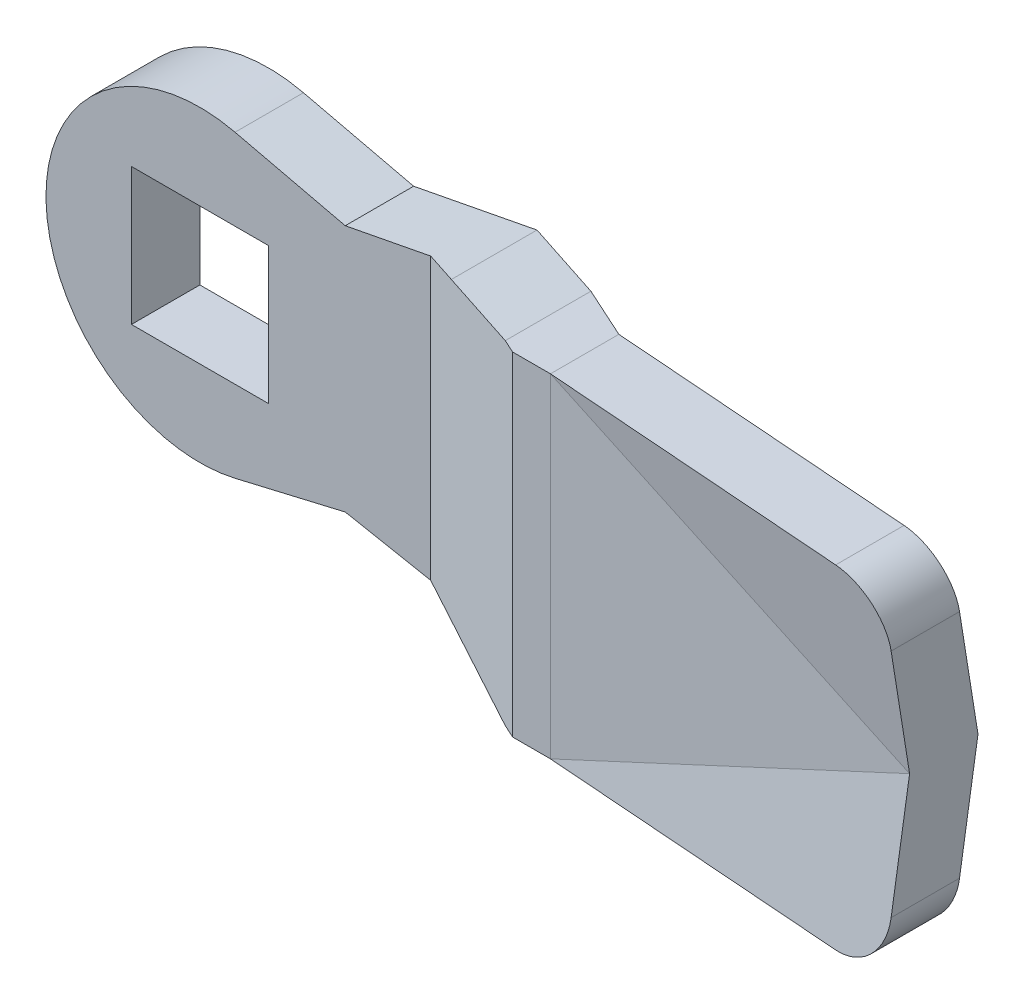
ISO-10303-21;
HEADER;
FILE_DESCRIPTION(('STEP AP214'),'2;1');
FILE_NAME('part.step','',(''),(''),'','','');
FILE_SCHEMA(('AUTOMOTIVE_DESIGN { 1 0 10303 214 1 1 1 1 }'));
ENDSEC;
DATA;
#1=APPLICATION_CONTEXT('core data for automotive mechanical design processes');
#2=APPLICATION_PROTOCOL_DEFINITION('international standard','automotive_design',2000,#1);
#3=PRODUCT_CONTEXT('',#1,'mechanical');
#4=PRODUCT('Part','Part','',(#3));
#5=PRODUCT_RELATED_PRODUCT_CATEGORY('part','',(#4));
#6=PRODUCT_DEFINITION_FORMATION('','',#4);
#7=PRODUCT_DEFINITION_CONTEXT('part definition',#1,'design');
#8=PRODUCT_DEFINITION('design','',#6,#7);
#9=PRODUCT_DEFINITION_SHAPE('','',#8);
#10=(LENGTH_UNIT() NAMED_UNIT(*) SI_UNIT(.MILLI.,.METRE.));
#11=(NAMED_UNIT(*) PLANE_ANGLE_UNIT() SI_UNIT($,.RADIAN.));
#12=(NAMED_UNIT(*) SI_UNIT($,.STERADIAN.) SOLID_ANGLE_UNIT());
#13=UNCERTAINTY_MEASURE_WITH_UNIT(LENGTH_MEASURE(1.E-05),#10,'distance_accuracy_value','');
#14=(GEOMETRIC_REPRESENTATION_CONTEXT(3) GLOBAL_UNCERTAINTY_ASSIGNED_CONTEXT((#13)) GLOBAL_UNIT_ASSIGNED_CONTEXT((#10,
#11,#12)) REPRESENTATION_CONTEXT('',''));
#15=CARTESIAN_POINT('',(0.,0.,0.));
#16=DIRECTION('',(0.,0.,1.));
#17=DIRECTION('',(1.,0.,0.));
#18=AXIS2_PLACEMENT_3D('',#15,#16,#17);
#19=CARTESIAN_POINT('',(36.,0.,8.));
#20=DIRECTION('',(0.,0.,1.));
#21=DIRECTION('',(1.,0.,0.));
#22=AXIS2_PLACEMENT_3D('',#19,#20,#21);
#23=PLANE('',#22);
#24=CARTESIAN_POINT('',(24.5,9.74999999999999,8.));
#25=DIRECTION('',(0.907008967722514,-0.421111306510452,0.));
#26=VECTOR('',#25,1.);
#27=LINE('',#24,#26);
#28=CARTESIAN_POINT('',(24.5,9.75,8.));
#29=VERTEX_POINT('',#28);
#30=CARTESIAN_POINT('',(45.4999999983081,0.,8.0000000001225));
#31=VERTEX_POINT('',#30);
#32=EDGE_CURVE('E203',#29,#31,#27,.T.);
#33=ORIENTED_EDGE('',*,*,#32,.F.);
#34=CARTESIAN_POINT('',(24.5,-9.75,8.));
#35=DIRECTION('',(0.,1.,0.));
#36=VECTOR('',#35,1.);
#37=LINE('',#34,#36);
#38=CARTESIAN_POINT('',(24.5,-9.75,8.));
#39=VERTEX_POINT('',#38);
#40=EDGE_CURVE('E197',#39,#29,#37,.T.);
#41=ORIENTED_EDGE('',*,*,#40,.F.);
#42=CARTESIAN_POINT('',(45.4999999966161,0.,8.));
#43=DIRECTION('',(-0.907008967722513,-0.421111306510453,0.));
#44=VECTOR('',#43,1.);
#45=LINE('',#42,#44);
#46=EDGE_CURVE('E200',#31,#39,#45,.T.);
#47=ORIENTED_EDGE('',*,*,#46,.F.);
#48=EDGE_LOOP('',(#33,#41,#47));
#49=FACE_BOUND('',#48,.T.);
#50=ADVANCED_FACE('F16',(#49),#23,.T.);
#51=CARTESIAN_POINT('',(39.2716939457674,8.32058902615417,8.8682408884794));
#52=DIRECTION('',(-0.0731252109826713,-0.157500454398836,0.984807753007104));
#53=DIRECTION('',(-0.907008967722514,0.421111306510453,0.));
#54=AXIS2_PLACEMENT_3D('',#51,#52,#53);
#55=PLANE('',#54);
#56=CARTESIAN_POINT('',(45.5,6.75,9.07952853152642));
#57=DIRECTION('',(0.,-0.987451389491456,-0.157923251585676));
#58=VECTOR('',#57,1.);
#59=LINE('',#56,#58);
#60=CARTESIAN_POINT('',(45.5,6.75,9.07952853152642));
#61=VERTEX_POINT('',#60);
#62=EDGE_CURVE('E1206',#61,#31,#59,.T.);
#63=ORIENTED_EDGE('',*,*,#62,.F.);
#64=CARTESIAN_POINT('',(42.51511117,9.75000000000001,9.33768118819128));
#65=CARTESIAN_POINT('',(42.5479097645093,9.74991721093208,9.34010331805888));
#66=CARTESIAN_POINT('',(42.5807137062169,9.74929471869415,9.3424347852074));
#67=CARTESIAN_POINT('',(42.6462692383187,9.7469717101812,9.34691407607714));
#68=CARTESIAN_POINT('',(42.6790208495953,9.74527206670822,9.34906204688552));
#69=CARTESIAN_POINT('',(42.7444363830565,9.74079774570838,9.35317434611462));
#70=CARTESIAN_POINT('',(42.777100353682,9.73802390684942,9.35513881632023));
#71=CARTESIAN_POINT('',(42.8423054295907,9.73140568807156,9.35888412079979));
#72=CARTESIAN_POINT('',(42.8748466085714,9.72756211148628,9.36066509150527));
#73=CARTESIAN_POINT('',(42.9397711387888,9.71880996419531,9.36404340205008));
#74=CARTESIAN_POINT('',(42.9721545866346,9.71390216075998,9.36564087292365));
#75=CARTESIAN_POINT('',(43.0367289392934,9.70302826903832,9.36865218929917));
#76=CARTESIAN_POINT('',(43.0689199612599,9.69706291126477,9.3700661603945));
#77=CARTESIAN_POINT('',(43.1330750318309,9.68408174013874,9.37271048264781));
#78=CARTESIAN_POINT('',(43.1650392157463,9.67706661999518,9.37394095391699));
#79=CARTESIAN_POINT('',(43.2287065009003,9.66199486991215,9.3762182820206));
#80=CARTESIAN_POINT('',(43.2604097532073,9.65393889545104,9.37726525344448));
#81=CARTESIAN_POINT('',(43.3235214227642,9.63679548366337,9.37917558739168));
#82=CARTESIAN_POINT('',(43.3549300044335,9.62770866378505,9.38003905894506));
#83=CARTESIAN_POINT('',(43.4174189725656,9.60851469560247,9.38158239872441));
#84=CARTESIAN_POINT('',(43.4484995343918,9.59840812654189,9.38226237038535));
#85=CARTESIAN_POINT('',(43.5102995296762,9.57718686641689,9.38343871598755));
#86=CARTESIAN_POINT('',(43.5410191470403,9.5660727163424,9.38393518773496));
#87=CARTESIAN_POINT('',(43.6020647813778,9.54284955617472,9.38474453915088));
#88=CARTESIAN_POINT('',(43.6323909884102,9.53074104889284,9.38505751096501));
#89=CARTESIAN_POINT('',(43.6926178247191,9.50554347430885,9.38549986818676));
#90=CARTESIAN_POINT('',(43.7225186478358,9.49245487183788,9.38562934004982));
#91=CARTESIAN_POINT('',(43.7818632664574,9.46531242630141,9.38570470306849));
#92=CARTESIAN_POINT('',(43.8113072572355,9.45125901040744,9.38565067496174));
#93=CARTESIAN_POINT('',(43.8697073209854,9.4222032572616,9.38535904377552));
#94=CARTESIAN_POINT('',(43.8986635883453,9.40720130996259,9.38512151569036));
#95=CARTESIAN_POINT('',(43.9560579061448,9.37626579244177,9.38446289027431));
#96=CARTESIAN_POINT('',(43.9844961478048,9.36033257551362,9.384041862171));
#97=CARTESIAN_POINT('',(44.040824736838,9.32755277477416,9.38301624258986));
#98=CARTESIAN_POINT('',(44.0687152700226,9.31070650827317,9.38241171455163));
#99=CARTESIAN_POINT('',(44.1239194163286,9.27611979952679,9.38101910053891));
#100=CARTESIAN_POINT('',(44.1512332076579,9.25837963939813,9.38023107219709));
#101=CARTESIAN_POINT('',(44.2052555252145,9.22202524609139,9.37847146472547));
#102=CARTESIAN_POINT('',(44.2319642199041,9.20341126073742,9.377499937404));
#103=CARTESIAN_POINT('',(44.284748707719,9.16533020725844,9.37537333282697));
#104=CARTESIAN_POINT('',(44.3108246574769,9.14586335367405,9.37421830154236));
#105=CARTESIAN_POINT('',(44.3623167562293,9.10609841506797,9.37172471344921));
#106=CARTESIAN_POINT('',(44.387733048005,9.08580051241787,9.3703861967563));
#107=CARTESIAN_POINT('',(44.4378796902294,9.04439616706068,9.36752557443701));
#108=CARTESIAN_POINT('',(44.4626101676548,9.02328987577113,9.36600350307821));
#109=CARTESIAN_POINT('',(44.5113598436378,8.98029223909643,9.36277603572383));
#110=CARTESIAN_POINT('',(44.5353791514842,8.9584010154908,9.36107066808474));
#111=CARTESIAN_POINT('',(44.582681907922,8.91385783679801,9.35747564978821));
#112=CARTESIAN_POINT('',(44.6059654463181,8.89120597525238,9.3555860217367));
#113=CARTESIAN_POINT('',(44.6518847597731,8.84505419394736,9.3516164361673));
#114=CARTESIAN_POINT('',(44.6745169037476,8.82155073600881,9.34953561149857));
#115=CARTESIAN_POINT('',(44.7191653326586,8.77363999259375,9.34518235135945));
#116=CARTESIAN_POINT('',(44.7411754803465,8.74922711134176,9.34290855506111));
#117=CARTESIAN_POINT('',(44.7845385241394,8.69950794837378,9.33816837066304));
#118=CARTESIAN_POINT('',(44.8058850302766,8.67419622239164,9.33570063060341));
#119=CARTESIAN_POINT('',(44.8478791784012,8.62269159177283,9.33057280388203));
#120=CARTESIAN_POINT('',(44.868520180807,8.59649340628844,9.32791138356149));
#121=CARTESIAN_POINT('',(44.9090614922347,8.54322999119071,9.32239610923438));
#122=CARTESIAN_POINT('',(44.9289549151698,8.51615965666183,9.31954093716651));
#123=CARTESIAN_POINT('',(44.9679591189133,8.46116801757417,9.31363816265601));
#124=CARTESIAN_POINT('',(44.9870627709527,8.43324179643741,9.31058925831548));
#125=CARTESIAN_POINT('',(45.0244454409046,8.37655644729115,9.30429899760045));
#126=CARTESIAN_POINT('',(45.0427170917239,8.3477926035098,9.30105635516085));
#127=CARTESIAN_POINT('',(45.07839381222,8.28945209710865,9.29437860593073));
#128=CARTESIAN_POINT('',(45.0957912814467,8.25987093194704,9.29094222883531));
#129=CARTESIAN_POINT('',(45.1296778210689,8.19991794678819,9.28387698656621));
#130=CARTESIAN_POINT('',(45.1461590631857,8.16954184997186,9.28024686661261));
#131=CARTESIAN_POINT('',(45.1781715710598,8.10802322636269,9.27279415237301));
#132=CARTESIAN_POINT('',(45.1936947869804,8.07687666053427,9.2689703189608));
#133=CARTESIAN_POINT('',(45.223749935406,8.01384360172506,9.26113005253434));
#134=CARTESIAN_POINT('',(45.2382736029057,7.9819533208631,9.25711239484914));
#135=CARTESIAN_POINT('',(45.2662889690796,7.91746093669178,9.24888487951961));
#136=CARTESIAN_POINT('',(45.2797721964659,7.88485530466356,9.24467381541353));
#137=CARTESIAN_POINT('',(45.3032082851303,7.82521811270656,9.23687561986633));
#138=CARTESIAN_POINT('',(45.3133554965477,7.79825918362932,9.23331544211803));
#139=CARTESIAN_POINT('',(45.3330237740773,7.74362627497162,9.22603131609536));
#140=CARTESIAN_POINT('',(45.3425317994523,7.71594782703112,9.22230563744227));
#141=CARTESIAN_POINT('',(45.3608754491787,7.65988643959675,9.21469086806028));
#142=CARTESIAN_POINT('',(45.3696976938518,7.63149934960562,9.21080010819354));
#143=CARTESIAN_POINT('',(45.3866230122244,7.57403327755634,9.20285500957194));
#144=CARTESIAN_POINT('',(45.3947123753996,7.54495048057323,9.19879905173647));
#145=CARTESIAN_POINT('',(45.4101245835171,7.48610808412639,9.19052353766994));
#146=CARTESIAN_POINT('',(45.4174333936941,7.45634502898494,9.18630241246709));
#147=CARTESIAN_POINT('',(45.4312367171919,7.39615970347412,9.17769650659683));
#148=CARTESIAN_POINT('',(45.4377168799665,7.36573435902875,9.17331020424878));
#149=CARTESIAN_POINT('',(45.4498147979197,7.30424466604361,9.16437390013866));
#150=CARTESIAN_POINT('',(45.4554178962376,7.27317764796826,9.15982242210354));
#151=CARTESIAN_POINT('',(45.4657133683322,7.21042753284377,9.15055572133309));
#152=CARTESIAN_POINT('',(45.4703907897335,7.17874219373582,9.14583906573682));
#153=CARTESIAN_POINT('',(45.4787865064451,7.11478117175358,9.13624196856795));
#154=CARTESIAN_POINT('',(45.4824895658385,7.08250369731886,9.13136013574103));
#155=CARTESIAN_POINT('',(45.4888882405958,7.01738703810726,9.12143263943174));
#156=CARTESIAN_POINT('',(45.4915683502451,6.98454653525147,9.11638562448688));
#157=CARTESIAN_POINT('',(45.4958729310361,6.918335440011,9.10612773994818));
#158=CARTESIAN_POINT('',(45.4974816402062,6.88496402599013,9.10091555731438));
#159=CARTESIAN_POINT('',(45.4995959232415,6.81772578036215,9.09032724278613));
#160=CARTESIAN_POINT('',(45.5000854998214,6.78385864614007,9.08494983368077));
#161=CARTESIAN_POINT('',(45.5,6.74999999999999,9.07952853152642));
#162=B_SPLINE_CURVE_WITH_KNOTS('',3,(#64,#65,#66,#67,#68,#69,#70,#71,#72,#73,#74,#75,#76,#77,
#78,#79,#80,#81,#82,#83,#84,#85,#86,#87,#88,#89,#90,#91,#92,#93,#94,#95,#96,#97,#98,#99,#100,
#101,#102,#103,#104,#105,#106,#107,#108,#109,#110,#111,#112,#113,#114,#115,#116,#117,#118,#119,
#120,#121,#122,#123,#124,#125,#126,#127,#128,#129,#130,#131,#132,#133,#134,#135,#136,#137,#138,
#139,#140,#141,#142,#143,#144,#145,#146,#147,#148,#149,#150,#151,#152,#153,#154,#155,#156,#157,
#158,#159,#160,#161),.UNSPECIFIED.,.F.,.F.,(4,2,2,2,2,2,2,2,2,2,2,2,2,2,2,2,2,2,2,2,2,2,2,2,2,2,
2,2,2,2,2,2,2,2,2,2,2,2,2,2,2,2,2,2,2,2,2,2,4),(0.,0.0986595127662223,0.197239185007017,
0.295742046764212,0.394171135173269,0.492529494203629,0.590820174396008,0.689046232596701,
0.787210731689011,0.885316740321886,0.983367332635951,1.08136558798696,1.17931459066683,
1.2772174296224,1.37507719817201,1.47289699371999,1.57067991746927,1.6684290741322,
1.76614757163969,1.86383852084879,1.96150503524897,2.05915023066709,2.1567772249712,
2.25438913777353,2.35198909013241,2.45005588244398,2.54888319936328,2.64847388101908,
2.7488307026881,2.84995637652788,2.9518535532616,3.05452482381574,3.15797272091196,
3.2621997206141,3.36720824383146,3.47300065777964,3.57957927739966,3.66664134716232,
3.7551351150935,3.84506171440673,3.93642222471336,4.02921767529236,4.12344904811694,
4.21911728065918,4.31622326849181,4.414767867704,4.51475189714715,4.61617614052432,
4.71904134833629),.UNSPECIFIED.);
#163=CARTESIAN_POINT('',(42.51511117,9.75,9.33768118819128));
#164=VERTEX_POINT('',#163);
#165=EDGE_CURVE('E241',#164,#61,#162,.T.);
#166=ORIENTED_EDGE('',*,*,#165,.F.);
#167=CARTESIAN_POINT('',(24.5,9.75,8.));
#168=DIRECTION('',(0.997254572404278,0.,0.0740494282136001));
#169=VECTOR('',#168,1.);
#170=LINE('',#167,#169);
#171=EDGE_CURVE('E1239',#29,#164,#170,.T.);
#172=ORIENTED_EDGE('',*,*,#171,.F.);
#173=ORIENTED_EDGE('',*,*,#32,.T.);
#174=EDGE_LOOP('',(#63,#166,#172,#173));
#175=FACE_BOUND('',#174,.T.);
#176=ADVANCED_FACE('F1352',(#175),#55,.T.);
#177=CARTESIAN_POINT('',(39.2716939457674,-8.32058902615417,8.8682408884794));
#178=DIRECTION('',(-0.073125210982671,0.157500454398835,0.984807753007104));
#179=DIRECTION('',(0.907008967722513,0.421111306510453,0.));
#180=AXIS2_PLACEMENT_3D('',#177,#178,#179);
#181=PLANE('',#180);
#182=CARTESIAN_POINT('',(45.5,3.91800307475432E-11,8.000000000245));
#183=DIRECTION('',(0.,-0.987451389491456,0.157923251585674));
#184=VECTOR('',#183,1.);
#185=LINE('',#182,#184);
#186=CARTESIAN_POINT('',(45.5,-6.75,9.07952853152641));
#187=VERTEX_POINT('',#186);
#188=EDGE_CURVE('E237',#31,#187,#185,.T.);
#189=ORIENTED_EDGE('',*,*,#188,.F.);
#190=ORIENTED_EDGE('',*,*,#46,.T.);
#191=CARTESIAN_POINT('',(42.51511117,-9.75,9.33768118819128));
#192=DIRECTION('',(-0.997254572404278,0.,-0.0740494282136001));
#193=VECTOR('',#192,1.);
#194=LINE('',#191,#193);
#195=CARTESIAN_POINT('',(42.51511117,-9.75,9.33768118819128));
#196=VERTEX_POINT('',#195);
#197=EDGE_CURVE('E215',#196,#39,#194,.T.);
#198=ORIENTED_EDGE('',*,*,#197,.F.);
#199=CARTESIAN_POINT('',(45.5,-6.74999999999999,9.0795285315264));
#200=CARTESIAN_POINT('',(45.5000854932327,-6.78385605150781,9.08494941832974));
#201=CARTESIAN_POINT('',(45.499595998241,-6.81772059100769,9.09032641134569));
#202=CARTESIAN_POINT('',(45.4974820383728,-6.88495412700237,9.10091397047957));
#203=CARTESIAN_POINT('',(45.4958735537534,-6.91832342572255,9.10612581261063));
#204=CARTESIAN_POINT('',(45.4915695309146,-6.98453077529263,9.11638309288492));
#205=CARTESIAN_POINT('',(45.4888897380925,-7.01736964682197,9.12142984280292));
#206=CARTESIAN_POINT('',(45.4824917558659,-7.08248352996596,9.13135688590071));
#207=CARTESIAN_POINT('',(45.4787890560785,-7.11475985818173,9.13623852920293));
#208=CARTESIAN_POINT('',(45.4703940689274,-7.17871907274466,9.14583532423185));
#209=CARTESIAN_POINT('',(45.4657170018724,-7.21040374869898,9.1505518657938));
#210=CARTESIAN_POINT('',(45.4554222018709,-7.273153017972,9.15981841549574));
#211=CARTESIAN_POINT('',(45.4498194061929,-7.30421985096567,9.16436985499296));
#212=CARTESIAN_POINT('',(45.4377220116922,-7.36570964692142,9.17330615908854));
#213=CARTESIAN_POINT('',(45.4312420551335,-7.39613527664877,9.17769249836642));
#214=CARTESIAN_POINT('',(45.4174390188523,-7.45632163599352,9.18629855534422));
#215=CARTESIAN_POINT('',(45.4101302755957,-7.48608543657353,9.1905197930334));
#216=CARTESIAN_POINT('',(45.3947180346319,-7.54492977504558,9.19879560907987));
#217=CARTESIAN_POINT('',(45.3866285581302,-7.57401376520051,9.20285175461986));
#218=CARTESIAN_POINT('',(45.3697028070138,-7.63148266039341,9.21079730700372));
#219=CARTESIAN_POINT('',(45.3608802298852,-7.6598713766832,9.21468833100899));
#220=CARTESIAN_POINT('',(45.3425356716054,-7.71593643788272,9.22230370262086));
#221=CARTESIAN_POINT('',(45.3330270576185,-7.74361692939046,9.22602971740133));
#222=CARTESIAN_POINT('',(45.3133573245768,-7.79825432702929,9.23331460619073));
#223=CARTESIAN_POINT('',(45.303209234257,-7.82521569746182,9.23687520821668));
#224=CARTESIAN_POINT('',(45.2797738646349,-7.88485105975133,9.24467337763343));
#225=CARTESIAN_POINT('',(45.2662924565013,-7.91745250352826,9.2488840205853));
#226=CARTESIAN_POINT('',(45.2382806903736,-7.98193740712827,9.25711076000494));
#227=CARTESIAN_POINT('',(45.2237587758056,-8.01382438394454,9.26112805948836));
#228=CARTESIAN_POINT('',(45.1937070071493,-8.07685170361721,9.26896769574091));
#229=CARTESIAN_POINT('',(45.1781853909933,-8.10799582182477,9.27279125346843));
#230=CARTESIAN_POINT('',(45.1461758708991,-8.16951039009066,9.28024349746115));
#231=CARTESIAN_POINT('',(45.1296959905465,-8.19988486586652,9.28387341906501));
#232=CARTESIAN_POINT('',(45.0958118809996,-8.25983541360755,9.29093834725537));
#233=CARTESIAN_POINT('',(45.0784154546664,-8.28941574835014,9.29437460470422));
#234=CARTESIAN_POINT('',(45.0427404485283,-8.34775535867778,9.30105219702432));
#235=CARTESIAN_POINT('',(45.0244694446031,-8.37651912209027,9.30429479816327));
#236=CARTESIAN_POINT('',(44.9870876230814,-8.43320503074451,9.3105850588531));
#237=CARTESIAN_POINT('',(44.9679841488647,-8.46113187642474,9.3136340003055));
#238=CARTESIAN_POINT('',(44.9289797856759,-8.51612543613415,9.3195369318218));
#239=CARTESIAN_POINT('',(44.909086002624,-8.54319705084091,9.32239221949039));
#240=CARTESIAN_POINT('',(44.8685433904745,-8.59646364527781,9.327907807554));
#241=CARTESIAN_POINT('',(44.847901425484,-8.62266371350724,9.33056942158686));
#242=CARTESIAN_POINT('',(44.8059047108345,-8.6741726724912,9.33569771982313));
#243=CARTESIAN_POINT('',(44.7845565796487,-8.69948682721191,9.3381657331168));
#244=CARTESIAN_POINT('',(44.7411895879,-8.74921135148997,9.34290654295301));
#245=CARTESIAN_POINT('',(44.7191770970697,-8.77362714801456,9.34518068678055));
#246=CARTESIAN_POINT('',(44.67452323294,-8.82154416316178,9.34953474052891));
#247=CARTESIAN_POINT('',(44.6518879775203,-8.84505095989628,9.35161600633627));
#248=CARTESIAN_POINT('',(44.6059662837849,-8.89120513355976,9.35558610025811));
#249=CARTESIAN_POINT('',(44.5826836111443,-8.91385617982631,9.35747582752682));
#250=CARTESIAN_POINT('',(44.535382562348,-8.95839785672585,9.36107102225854));
#251=CARTESIAN_POINT('',(44.511364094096,-8.98028839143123,9.36277646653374));
#252=CARTESIAN_POINT('',(44.4626160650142,-9.02328477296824,9.36600408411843));
#253=CARTESIAN_POINT('',(44.4378863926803,-9.0443904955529,9.3675262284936));
#254=CARTESIAN_POINT('',(44.3877413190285,-9.08579382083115,9.3703869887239));
#255=CARTESIAN_POINT('',(44.3623257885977,-9.10609126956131,9.37172556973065));
#256=CARTESIAN_POINT('',(44.3108351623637,-9.14585541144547,9.37421927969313));
#257=CARTESIAN_POINT('',(44.2847599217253,-9.16532191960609,9.37537436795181));
#258=CARTESIAN_POINT('',(44.2319767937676,-9.20340238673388,9.37750107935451));
#259=CARTESIAN_POINT('',(44.2052687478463,-9.22201612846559,9.37847265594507));
#260=CARTESIAN_POINT('',(44.1512476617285,-9.25837013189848,9.38023235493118));
#261=CARTESIAN_POINT('',(44.1239344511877,-9.27611014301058,9.38102042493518));
#262=CARTESIAN_POINT('',(44.0687313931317,-9.31069664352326,9.382413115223));
#263=CARTESIAN_POINT('',(44.0408413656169,-9.32754284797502,9.38301767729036));
#264=CARTESIAN_POINT('',(43.9845137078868,-9.36032260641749,9.38404335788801));
#265=CARTESIAN_POINT('',(43.956075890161,-9.37625584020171,9.38446441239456));
#266=CARTESIAN_POINT('',(43.8986823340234,-9.40719146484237,9.38512308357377));
#267=CARTESIAN_POINT('',(43.8697264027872,-9.42219349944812,9.38536063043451));
#268=CARTESIAN_POINT('',(43.8113269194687,-9.45124949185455,9.38565229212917));
#269=CARTESIAN_POINT('',(43.7818831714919,-9.46530305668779,9.38570633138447));
#270=CARTESIAN_POINT('',(43.7225389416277,-9.49244585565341,9.38563098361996));
#271=CARTESIAN_POINT('',(43.6926382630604,-9.50553465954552,9.38550151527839));
#272=CARTESIAN_POINT('',(43.6324116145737,-9.53073268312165,9.38505915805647));
#273=CARTESIAN_POINT('',(43.6020854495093,-9.54284143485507,9.38474618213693));
#274=CARTESIAN_POINT('',(43.5410397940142,-9.56606512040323,9.3839368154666));
#275=CARTESIAN_POINT('',(43.5103201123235,-9.57717954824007,9.38344033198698));
#276=CARTESIAN_POINT('',(43.4485198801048,-9.59840139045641,9.38226395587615));
#277=CARTESIAN_POINT('',(43.4174391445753,-9.60850826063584,9.38158396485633));
#278=CARTESIAN_POINT('',(43.35494971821,-9.62770284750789,9.38004057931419));
#279=CARTESIAN_POINT('',(43.3235408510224,-9.63678998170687,9.37917708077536));
#280=CARTESIAN_POINT('',(43.2604284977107,-9.65393402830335,9.37726668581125));
#281=CARTESIAN_POINT('',(43.2287248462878,-9.66199031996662,9.37621967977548));
#282=CARTESIAN_POINT('',(43.1650566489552,-9.67706270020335,9.37394227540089));
#283=CARTESIAN_POINT('',(43.1330919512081,-9.68407812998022,9.37271176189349));
#284=CARTESIAN_POINT('',(43.0689357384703,-9.69705990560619,9.3700673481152));
#285=CARTESIAN_POINT('',(43.0367440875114,-9.70302555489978,9.36865332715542));
#286=CARTESIAN_POINT('',(42.9721683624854,-9.71390000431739,9.36564190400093));
#287=CARTESIAN_POINT('',(42.9397841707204,-9.71880807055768,9.36404437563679));
#288=CARTESIAN_POINT('',(42.8748580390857,-9.72756070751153,9.36066594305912));
#289=CARTESIAN_POINT('',(42.8423160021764,-9.73140450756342,9.35888490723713));
#290=CARTESIAN_POINT('',(42.7771090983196,-9.73802312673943,9.35513946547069));
#291=CARTESIAN_POINT('',(42.744444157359,-9.74079713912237,9.35317492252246));
#292=CARTESIAN_POINT('',(42.6790265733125,-9.7452717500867,9.3490624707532));
#293=CARTESIAN_POINT('',(42.6462738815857,-9.74697150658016,9.34691441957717));
#294=CARTESIAN_POINT('',(42.5807160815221,-9.74929467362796,9.34243496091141));
#295=CARTESIAN_POINT('',(42.5479109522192,-9.74991720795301,9.3401034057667));
#296=CARTESIAN_POINT('',(42.51511117,-9.74999999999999,9.33768118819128));
#297=B_SPLINE_CURVE_WITH_KNOTS('',3,(#199,#200,#201,#202,#203,#204,#205,#206,#207,#208,#209,
#210,#211,#212,#213,#214,#215,#216,#217,#218,#219,#220,#221,#222,#223,#224,#225,#226,#227,#228,
#229,#230,#231,#232,#233,#234,#235,#236,#237,#238,#239,#240,#241,#242,#243,#244,#245,#246,#247,
#248,#249,#250,#251,#252,#253,#254,#255,#256,#257,#258,#259,#260,#261,#262,#263,#264,#265,#266,
#267,#268,#269,#270,#271,#272,#273,#274,#275,#276,#277,#278,#279,#280,#281,#282,#283,#284,#285,
#286,#287,#288,#289,#290,#291,#292,#293,#294,#295,#296),.UNSPECIFIED.,.F.,.F.,(4,2,2,2,2,2,2,2,
2,2,2,2,2,2,2,2,2,2,2,2,2,2,2,2,2,2,2,2,2,2,2,2,2,2,2,2,2,2,2,2,2,2,2,2,2,2,2,2,4),(0.,
0.102857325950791,0.204275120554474,0.30425413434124,0.402795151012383,0.499898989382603,
0.595566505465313,0.689798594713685,0.782596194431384,0.873960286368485,0.963891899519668,
1.05239211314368,1.13946206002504,1.24602693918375,1.35180810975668,1.4568078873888,
1.56102863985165,1.6644727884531,1.76714280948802,1.8690412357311,1.9701706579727,
2.07053372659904,2.17013315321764,2.26897171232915,2.36705224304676,2.46464865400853,
2.56225733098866,2.65988139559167,2.75752396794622,2.85518816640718,2.95287710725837,
3.05059390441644,3.14834166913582,3.2461235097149,3.34394253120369,3.44180183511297,
3.53970451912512,3.63765367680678,3.73565239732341,3.83370376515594,3.93181085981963,
4.02997675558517,4.12820452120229,4.22649721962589,4.32485790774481,4.42328963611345,
4.52179544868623,4.62037838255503,4.71904146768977),.UNSPECIFIED.);
#298=EDGE_CURVE('E229',#187,#196,#297,.T.);
#299=ORIENTED_EDGE('',*,*,#298,.F.);
#300=EDGE_LOOP('',(#189,#190,#198,#299));
#301=FACE_BOUND('',#300,.T.);
#302=ADVANCED_FACE('F235',(#301),#181,.T.);
#303=CARTESIAN_POINT('',(42.5075364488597,6.75753654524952,-1.));
#304=DIRECTION('',(0.,0.,1.));
#305=DIRECTION('',(0.999996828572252,-0.00251850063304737,0.));
#306=AXIS2_PLACEMENT_3D('',#303,#304,#305);
#307=CYLINDRICAL_SURFACE('',#306,2.99247304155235);
#308=ORIENTED_EDGE('',*,*,#165,.T.);
#309=CARTESIAN_POINT('',(45.5,6.75,5.07952853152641));
#310=DIRECTION('',(0.,0.,1.));
#311=VECTOR('',#310,1.);
#312=LINE('',#309,#311);
#313=CARTESIAN_POINT('',(45.5,6.75,5.07952853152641));
#314=VERTEX_POINT('',#313);
#315=EDGE_CURVE('E1212',#314,#61,#312,.T.);
#316=ORIENTED_EDGE('',*,*,#315,.F.);
#317=CARTESIAN_POINT('',(45.5,6.74999999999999,5.07952853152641));
#318=CARTESIAN_POINT('',(45.5000854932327,6.78385605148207,5.08494941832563));
#319=CARTESIAN_POINT('',(45.4995959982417,6.81772059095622,5.09032641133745));
#320=CARTESIAN_POINT('',(45.4974820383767,6.88495412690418,5.10091397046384));
#321=CARTESIAN_POINT('',(45.4958735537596,6.91832342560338,5.10612581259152));
#322=CARTESIAN_POINT('',(45.4915695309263,6.98453077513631,5.11638309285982));
#323=CARTESIAN_POINT('',(45.4888897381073,7.01736964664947,5.12142984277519));
#324=CARTESIAN_POINT('',(45.4824917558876,7.08248352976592,5.13135688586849));
#325=CARTESIAN_POINT('',(45.4787890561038,7.11475985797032,5.13623852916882));
#326=CARTESIAN_POINT('',(45.4703940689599,7.17871907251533,5.14583532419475));
#327=CARTESIAN_POINT('',(45.4657170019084,7.21040374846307,5.15055186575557));
#328=CARTESIAN_POINT('',(45.4554222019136,7.2731530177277,5.15981841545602));
#329=CARTESIAN_POINT('',(45.4498194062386,7.30421985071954,5.16436985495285));
#330=CARTESIAN_POINT('',(45.4377220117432,7.36570964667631,5.17330615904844));
#331=CARTESIAN_POINT('',(45.4312420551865,7.39613527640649,5.17769249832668));
#332=CARTESIAN_POINT('',(45.4174390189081,7.45632163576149,5.18629855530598));
#333=CARTESIAN_POINT('',(45.4101302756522,7.4860854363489,5.19051979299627));
#334=CARTESIAN_POINT('',(45.394718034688,7.5449297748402,5.19879560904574));
#335=CARTESIAN_POINT('',(45.3866285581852,7.57401376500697,5.20285175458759));
#336=CARTESIAN_POINT('',(45.3697028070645,7.63148266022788,5.21079730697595));
#337=CARTESIAN_POINT('',(45.3608802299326,7.6598713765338,5.21468833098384));
#338=CARTESIAN_POINT('',(45.3425356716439,7.71593643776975,5.22230370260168));
#339=CARTESIAN_POINT('',(45.333027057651,7.74361692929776,5.22602971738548));
#340=CARTESIAN_POINT('',(45.3133573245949,7.79825432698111,5.23331460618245));
#341=CARTESIAN_POINT('',(45.3032092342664,7.82521569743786,5.23687520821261));
#342=CARTESIAN_POINT('',(45.2797738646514,7.88485105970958,5.24467337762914));
#343=CARTESIAN_POINT('',(45.2662924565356,7.91745250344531,5.24888402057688));
#344=CARTESIAN_POINT('',(45.2382806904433,7.98193740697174,5.25711075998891));
#345=CARTESIAN_POINT('',(45.2237587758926,8.01382438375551,5.26112805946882));
#346=CARTESIAN_POINT('',(45.1937070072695,8.07685170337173,5.26896769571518));
#347=CARTESIAN_POINT('',(45.1781853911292,8.10799582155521,5.27279125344));
#348=CARTESIAN_POINT('',(45.1461758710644,8.16951038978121,5.2802434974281));
#349=CARTESIAN_POINT('',(45.1296959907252,8.19988486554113,5.28387341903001));
#350=CARTESIAN_POINT('',(45.0958118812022,8.25983541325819,5.29093834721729));
#351=CARTESIAN_POINT('',(45.0784154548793,8.28941574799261,5.29437460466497));
#352=CARTESIAN_POINT('',(45.042740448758,8.34775535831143,5.30105219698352));
#353=CARTESIAN_POINT('',(45.0244694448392,8.37651912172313,5.30429479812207));
#354=CARTESIAN_POINT('',(44.9870876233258,8.43320503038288,5.3105850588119));
#355=CARTESIAN_POINT('',(44.9679841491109,8.46113187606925,5.31363400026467));
#356=CARTESIAN_POINT('',(44.9289797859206,8.51612543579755,5.3195369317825));
#357=CARTESIAN_POINT('',(44.9090860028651,8.5431970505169,5.32239221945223));
#358=CARTESIAN_POINT('',(44.8685433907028,8.59646364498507,5.32790780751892));
#359=CARTESIAN_POINT('',(44.8479014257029,8.62266371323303,5.33056942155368));
#360=CARTESIAN_POINT('',(44.8059047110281,8.67417267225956,5.33569771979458));
#361=CARTESIAN_POINT('',(44.7845565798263,8.69948682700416,5.33816573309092));
#362=CARTESIAN_POINT('',(44.7411895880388,8.74921135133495,5.34290654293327));
#363=CARTESIAN_POINT('',(44.7191770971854,8.77362714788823,5.34518068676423));
#364=CARTESIAN_POINT('',(44.6745232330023,8.82154416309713,5.34953474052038));
#365=CARTESIAN_POINT('',(44.6518879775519,8.84505095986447,5.35161600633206));
#366=CARTESIAN_POINT('',(44.6059662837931,8.89120513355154,5.35558610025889));
#367=CARTESIAN_POINT('',(44.582683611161,8.91385617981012,5.35747582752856));
#368=CARTESIAN_POINT('',(44.5353825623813,8.95839785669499,5.36107102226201));
#369=CARTESIAN_POINT('',(44.5113640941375,8.98028839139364,5.36277646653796));
#370=CARTESIAN_POINT('',(44.4626160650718,9.02328477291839,5.36600408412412));
#371=CARTESIAN_POINT('',(44.4378863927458,9.04439049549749,5.3675262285));
#372=CARTESIAN_POINT('',(44.3877413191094,9.08579382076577,5.37038698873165));
#373=CARTESIAN_POINT('',(44.362325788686,9.1060912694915,5.37172556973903));
#374=CARTESIAN_POINT('',(44.3108351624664,9.14585541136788,5.3742192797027));
#375=CARTESIAN_POINT('',(44.2847599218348,9.16532191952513,5.37537436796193));
#376=CARTESIAN_POINT('',(44.2319767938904,9.20340238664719,5.37750107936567));
#377=CARTESIAN_POINT('',(44.2052687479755,9.22201612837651,5.37847265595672));
#378=CARTESIAN_POINT('',(44.1512476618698,9.2583701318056,5.38023235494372));
#379=CARTESIAN_POINT('',(44.1239344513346,9.27611014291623,5.38102042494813));
#380=CARTESIAN_POINT('',(44.0687313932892,9.31069664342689,5.38241311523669));
#381=CARTESIAN_POINT('',(44.0408413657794,9.32754284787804,5.38301767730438));
#382=CARTESIAN_POINT('',(43.9845137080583,9.36032260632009,5.38404335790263));
#383=CARTESIAN_POINT('',(43.9560758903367,9.37625584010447,5.38446441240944));
#384=CARTESIAN_POINT('',(43.8986823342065,9.40719146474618,5.3851230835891));
#385=CARTESIAN_POINT('',(43.8697264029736,9.42219349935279,5.38536063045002));
#386=CARTESIAN_POINT('',(43.8113269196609,9.45124949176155,5.38565229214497));
#387=CARTESIAN_POINT('',(43.7818831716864,9.46530305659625,5.38570633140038));
#388=CARTESIAN_POINT('',(43.722538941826,9.49244585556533,5.38563098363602));
#389=CARTESIAN_POINT('',(43.6926382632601,9.5055346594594,5.38550151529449));
#390=CARTESIAN_POINT('',(43.6324116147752,9.53073268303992,5.38505915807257));
#391=CARTESIAN_POINT('',(43.6020854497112,9.54284143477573,5.38474618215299));
#392=CARTESIAN_POINT('',(43.541039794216,9.56606512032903,5.3839368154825));
#393=CARTESIAN_POINT('',(43.5103201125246,9.57717954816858,5.38344033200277));
#394=CARTESIAN_POINT('',(43.4485198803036,9.5984013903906,5.38226395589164));
#395=CARTESIAN_POINT('',(43.4174391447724,9.60850826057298,5.38158396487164));
#396=CARTESIAN_POINT('',(43.3549497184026,9.62770284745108,5.38004057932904));
#397=CARTESIAN_POINT('',(43.3235408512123,9.63678998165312,5.37917708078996));
#398=CARTESIAN_POINT('',(43.2604284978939,9.6539340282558,5.37726668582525));
#399=CARTESIAN_POINT('',(43.228724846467,9.66199031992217,5.37621967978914));
#400=CARTESIAN_POINT('',(43.1650566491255,9.67706270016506,5.37394227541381));
#401=CARTESIAN_POINT('',(43.1330919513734,9.68407812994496,5.37271176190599));
#402=CARTESIAN_POINT('',(43.0689357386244,9.69705990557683,5.3700673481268));
#403=CARTESIAN_POINT('',(43.0367440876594,9.70302555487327,5.36865332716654));
#404=CARTESIAN_POINT('',(42.9721683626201,9.71390000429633,5.36564190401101));
#405=CARTESIAN_POINT('',(42.9397841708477,9.71880807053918,5.3640443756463));
#406=CARTESIAN_POINT('',(42.8748580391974,9.72756070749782,5.36066594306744));
#407=CARTESIAN_POINT('',(42.8423160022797,9.7314045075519,5.35888490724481));
#408=CARTESIAN_POINT('',(42.777109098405,9.73802312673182,5.35513946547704));
#409=CARTESIAN_POINT('',(42.7444441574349,9.74079713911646,5.35317492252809));
#410=CARTESIAN_POINT('',(42.6790265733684,9.74527175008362,5.34906247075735));
#411=CARTESIAN_POINT('',(42.646273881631,9.74697150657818,5.34691441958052));
#412=CARTESIAN_POINT('',(42.5807160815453,9.74929467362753,5.34243496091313));
#413=CARTESIAN_POINT('',(42.5479109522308,9.74991720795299,5.34010340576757));
#414=CARTESIAN_POINT('',(42.51511117,9.75000000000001,5.33768118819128));
#415=B_SPLINE_CURVE_WITH_KNOTS('',3,(#317,#318,#319,#320,#321,#322,#323,#324,#325,#326,#327,
#328,#329,#330,#331,#332,#333,#334,#335,#336,#337,#338,#339,#340,#341,#342,#343,#344,#345,#346,
#347,#348,#349,#350,#351,#352,#353,#354,#355,#356,#357,#358,#359,#360,#361,#362,#363,#364,#365,
#366,#367,#368,#369,#370,#371,#372,#373,#374,#375,#376,#377,#378,#379,#380,#381,#382,#383,#384,
#385,#386,#387,#388,#389,#390,#391,#392,#393,#394,#395,#396,#397,#398,#399,#400,#401,#402,#403,
#404,#405,#406,#407,#408,#409,#410,#411,#412,#413,#414),.UNSPECIFIED.,.F.,.F.,(4,2,2,2,2,2,2,2,
2,2,2,2,2,2,2,2,2,2,2,2,2,2,2,2,2,2,2,2,2,2,2,2,2,2,2,2,2,2,2,2,2,2,2,2,2,2,2,2,4),(0.,
0.102857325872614,0.204275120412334,0.304254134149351,0.402795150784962,0.49989898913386,
0.595566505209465,0.689798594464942,0.782596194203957,0.873960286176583,0.963891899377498,
1.05239211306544,1.13946206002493,1.24602693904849,1.35180810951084,1.45680788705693,
1.56102863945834,1.66447278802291,1.76714280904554,1.86904123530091,1.97017065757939,
2.07053372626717,2.17013315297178,2.26897171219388,2.36705224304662,2.46464865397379,
2.56225733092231,2.65988139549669,2.75752396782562,2.85518816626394,2.95287710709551,
3.05059390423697,3.14834166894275,3.24612350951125,3.34394253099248,3.44180183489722,
3.53970451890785,3.63765367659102,3.7356523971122,3.83370376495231,3.93181085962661,
4.0299767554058,4.12820452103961,4.22649721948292,4.3248579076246,4.42328963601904,
4.52179544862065,4.62037838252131,4.71904146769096),.UNSPECIFIED.);
#416=CARTESIAN_POINT('',(42.51511117,9.75,5.33768118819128));
#417=VERTEX_POINT('',#416);
#418=EDGE_CURVE('E1188',#314,#417,#415,.T.);
#419=ORIENTED_EDGE('',*,*,#418,.T.);
#420=CARTESIAN_POINT('',(42.51511117,9.75,9.33768118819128));
#421=DIRECTION('',(0.,0.,-1.));
#422=VECTOR('',#421,1.);
#423=LINE('',#420,#422);
#424=EDGE_CURVE('E230',#164,#417,#423,.T.);
#425=ORIENTED_EDGE('',*,*,#424,.F.);
#426=EDGE_LOOP('',(#308,#316,#419,#425));
#427=FACE_BOUND('',#426,.T.);
#428=ADVANCED_FACE('F1373',(#427),#307,.T.);
#429=CARTESIAN_POINT('',(33.507555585,9.75,-1.));
#430=DIRECTION('',(0.,1.,0.));
#431=DIRECTION('',(1.,0.,0.));
#432=AXIS2_PLACEMENT_3D('',#429,#430,#431);
#433=PLANE('',#432);
#434=ORIENTED_EDGE('',*,*,#171,.T.);
#435=ORIENTED_EDGE('',*,*,#424,.T.);
#436=CARTESIAN_POINT('',(42.51511117,9.75,5.33768118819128));
#437=DIRECTION('',(-0.997254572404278,0.,-0.0740494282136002));
#438=VECTOR('',#437,1.);
#439=LINE('',#436,#438);
#440=CARTESIAN_POINT('',(24.5,9.75,4.));
#441=VERTEX_POINT('',#440);
#442=EDGE_CURVE('E1182',#417,#441,#439,.T.);
#443=ORIENTED_EDGE('',*,*,#442,.T.);
#444=CARTESIAN_POINT('',(24.5,9.75,4.));
#445=DIRECTION('',(0.,0.,1.));
#446=VECTOR('',#445,1.);
#447=LINE('',#444,#446);
#448=EDGE_CURVE('E190',#441,#29,#447,.T.);
#449=ORIENTED_EDGE('',*,*,#448,.T.);
#450=EDGE_LOOP('',(#434,#435,#443,#449));
#451=FACE_BOUND('',#450,.T.);
#452=ADVANCED_FACE('F1384',(#451),#433,.T.);
#453=CARTESIAN_POINT('',(33.507555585,-9.75,-1.));
#454=DIRECTION('',(0.,-1.,0.));
#455=DIRECTION('',(0.,0.,-1.));
#456=AXIS2_PLACEMENT_3D('',#453,#454,#455);
#457=PLANE('',#456);
#458=ORIENTED_EDGE('',*,*,#197,.T.);
#459=CARTESIAN_POINT('',(24.5,-9.75,8.));
#460=DIRECTION('',(0.,0.,-1.));
#461=VECTOR('',#460,1.);
#462=LINE('',#459,#461);
#463=CARTESIAN_POINT('',(24.5,-9.75,4.));
#464=VERTEX_POINT('',#463);
#465=EDGE_CURVE('E219',#39,#464,#462,.T.);
#466=ORIENTED_EDGE('',*,*,#465,.T.);
#467=CARTESIAN_POINT('',(24.5,-9.75,4.));
#468=DIRECTION('',(0.997254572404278,0.,0.0740494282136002));
#469=VECTOR('',#468,1.);
#470=LINE('',#467,#469);
#471=CARTESIAN_POINT('',(42.51511117,-9.75,5.33768118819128));
#472=VERTEX_POINT('',#471);
#473=EDGE_CURVE('E1169',#464,#472,#470,.T.);
#474=ORIENTED_EDGE('',*,*,#473,.T.);
#475=CARTESIAN_POINT('',(42.51511117,-9.74999999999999,9.33768118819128));
#476=DIRECTION('',(0.,0.,-1.));
#477=VECTOR('',#476,1.);
#478=LINE('',#475,#477);
#479=EDGE_CURVE('E223',#196,#472,#478,.T.);
#480=ORIENTED_EDGE('',*,*,#479,.F.);
#481=EDGE_LOOP('',(#458,#466,#474,#480));
#482=FACE_BOUND('',#481,.T.);
#483=ADVANCED_FACE('F217',(#482),#457,.T.);
#484=CARTESIAN_POINT('',(42.5075364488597,-6.75753654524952,-1.));
#485=DIRECTION('',(0.,0.,1.));
#486=DIRECTION('',(0.00253125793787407,-0.999996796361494,0.));
#487=AXIS2_PLACEMENT_3D('',#484,#485,#486);
#488=CYLINDRICAL_SURFACE('',#487,2.99247304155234);
#489=ORIENTED_EDGE('',*,*,#298,.T.);
#490=ORIENTED_EDGE('',*,*,#479,.T.);
#491=CARTESIAN_POINT('',(42.51511117,-9.74999999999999,5.33768118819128));
#492=CARTESIAN_POINT('',(42.5479097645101,-9.74991721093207,5.34010331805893));
#493=CARTESIAN_POINT('',(42.5807137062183,-9.74929471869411,5.34243478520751));
#494=CARTESIAN_POINT('',(42.6462692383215,-9.74697171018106,5.34691407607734));
#495=CARTESIAN_POINT('',(42.6790208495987,-9.74527206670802,5.34906204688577));
#496=CARTESIAN_POINT('',(42.7444363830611,-9.74079774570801,5.35317434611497));
#497=CARTESIAN_POINT('',(42.7771003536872,-9.73802390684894,5.35513881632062));
#498=CARTESIAN_POINT('',(42.8423054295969,-9.73140568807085,5.35888412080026));
#499=CARTESIAN_POINT('',(42.8748466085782,-9.72756211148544,5.36066509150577));
#500=CARTESIAN_POINT('',(42.9397711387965,-9.71880996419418,5.36404340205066));
#501=CARTESIAN_POINT('',(42.9721545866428,-9.71390216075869,5.36564087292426));
#502=CARTESIAN_POINT('',(43.0367289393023,-9.7030282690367,5.36865218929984));
#503=CARTESIAN_POINT('',(43.0689199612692,-9.69706291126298,5.37006616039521));
#504=CARTESIAN_POINT('',(43.1330750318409,-9.68408174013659,5.37271048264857));
#505=CARTESIAN_POINT('',(43.1650392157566,-9.67706661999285,5.37394095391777));
#506=CARTESIAN_POINT('',(43.2287065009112,-9.66199486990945,5.37621828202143));
#507=CARTESIAN_POINT('',(43.2604097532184,-9.65393889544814,5.37726525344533));
#508=CARTESIAN_POINT('',(43.3235214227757,-9.6367954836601,5.37917558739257));
#509=CARTESIAN_POINT('',(43.3549300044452,-9.6277086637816,5.38003905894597));
#510=CARTESIAN_POINT('',(43.4174189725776,-9.60851469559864,5.38158239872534));
#511=CARTESIAN_POINT('',(43.4484995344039,-9.59840812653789,5.38226237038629));
#512=CARTESIAN_POINT('',(43.5102995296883,-9.57718686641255,5.38343871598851));
#513=CARTESIAN_POINT('',(43.5410191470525,-9.56607271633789,5.38393518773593));
#514=CARTESIAN_POINT('',(43.6020647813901,-9.54284955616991,5.38474453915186));
#515=CARTESIAN_POINT('',(43.6323909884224,-9.53074104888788,5.38505751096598));
#516=CARTESIAN_POINT('',(43.6926178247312,-9.50554347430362,5.38549986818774));
#517=CARTESIAN_POINT('',(43.7225186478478,-9.49245487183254,5.38562934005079));
#518=CARTESIAN_POINT('',(43.7818632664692,-9.46531242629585,5.38570470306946));
#519=CARTESIAN_POINT('',(43.8113072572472,-9.4512590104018,5.3856506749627));
#520=CARTESIAN_POINT('',(43.8697073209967,-9.42220325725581,5.38535904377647));
#521=CARTESIAN_POINT('',(43.8986635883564,-9.40720130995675,5.3851215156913));
#522=CARTESIAN_POINT('',(43.9560579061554,-9.37626579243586,5.38446289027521));
#523=CARTESIAN_POINT('',(43.9844961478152,-9.36033257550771,5.38404186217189));
#524=CARTESIAN_POINT('',(44.0408247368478,-9.32755277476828,5.38301624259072));
#525=CARTESIAN_POINT('',(44.0687152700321,-9.31070650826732,5.38241171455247));
#526=CARTESIAN_POINT('',(44.1239194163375,-9.27611979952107,5.3810191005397));
#527=CARTESIAN_POINT('',(44.1512332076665,-9.25837963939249,5.38023107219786));
#528=CARTESIAN_POINT('',(44.2052555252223,-9.22202524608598,5.37847146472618));
#529=CARTESIAN_POINT('',(44.2319642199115,-9.20341126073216,5.37749993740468));
#530=CARTESIAN_POINT('',(44.2847487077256,-9.16533020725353,5.37537333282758));
#531=CARTESIAN_POINT('',(44.3108246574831,-9.14586335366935,5.37421830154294));
#532=CARTESIAN_POINT('',(44.3623167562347,-9.10609841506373,5.37172471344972));
#533=CARTESIAN_POINT('',(44.3877330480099,-9.0858005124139,5.37038619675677));
#534=CARTESIAN_POINT('',(44.4378796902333,-9.04439616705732,5.3675255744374));
#535=CARTESIAN_POINT('',(44.4626101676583,-9.0232898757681,5.36600350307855));
#536=CARTESIAN_POINT('',(44.5113598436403,-8.98029223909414,5.36277603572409));
#537=CARTESIAN_POINT('',(44.5353791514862,-8.95840101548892,5.36107066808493));
#538=CARTESIAN_POINT('',(44.582681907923,-8.91385783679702,5.35747564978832));
#539=CARTESIAN_POINT('',(44.6059654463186,-8.89120597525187,5.35558602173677));
#540=CARTESIAN_POINT('',(44.651884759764,-8.84505419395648,5.35161643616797));
#541=CARTESIAN_POINT('',(44.6745169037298,-8.82155073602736,5.34953561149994));
#542=CARTESIAN_POINT('',(44.7191653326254,-8.77363999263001,5.34518235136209));
#543=CARTESIAN_POINT('',(44.7411754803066,-8.74922711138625,5.34290855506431));
#544=CARTESIAN_POINT('',(44.7845385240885,-8.69950794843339,5.33816837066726));
#545=CARTESIAN_POINT('',(44.805885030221,-8.67419622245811,5.33570063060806));
#546=CARTESIAN_POINT('',(44.8478791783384,-8.62269159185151,5.33057280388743));
#547=CARTESIAN_POINT('',(44.8685201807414,-8.59649340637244,5.3279113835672));
#548=CARTESIAN_POINT('',(44.9090614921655,-8.54322999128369,5.3223961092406));
#549=CARTESIAN_POINT('',(44.9289549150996,-8.51615965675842,5.31954093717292));
#550=CARTESIAN_POINT('',(44.9679591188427,-8.46116801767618,5.31363816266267));
#551=CARTESIAN_POINT('',(44.9870627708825,-8.43324179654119,5.31058925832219));
#552=CARTESIAN_POINT('',(45.0244454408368,-8.37655644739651,5.30429899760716));
#553=CARTESIAN_POINT('',(45.0427170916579,-8.34779260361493,5.30105635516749));
#554=CARTESIAN_POINT('',(45.0783938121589,-8.28945209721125,5.29437860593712));
#555=CARTESIAN_POINT('',(45.0957912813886,-8.2598709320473,5.29094222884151));
#556=CARTESIAN_POINT('',(45.1296778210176,-8.19991794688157,5.2838769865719));
#557=CARTESIAN_POINT('',(45.1461590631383,-8.16954185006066,5.28024686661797));
#558=CARTESIAN_POINT('',(45.1781715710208,-8.10802322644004,5.27279415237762));
#559=CARTESIAN_POINT('',(45.1936947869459,-8.07687666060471,5.26897031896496));
#560=CARTESIAN_POINT('',(45.2237499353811,-8.0138436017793,5.26113005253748));
#561=CARTESIAN_POINT('',(45.2382736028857,-7.98195332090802,5.2571123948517));
#562=CARTESIAN_POINT('',(45.2662889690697,-7.91746093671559,5.24888487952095));
#563=CARTESIAN_POINT('',(45.2797721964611,-7.88485530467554,5.24467381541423));
#564=CARTESIAN_POINT('',(45.3032082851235,-7.82521811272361,5.23687561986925));
#565=CARTESIAN_POINT('',(45.3133554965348,-7.79825918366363,5.23331544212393));
#566=CARTESIAN_POINT('',(45.3330237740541,-7.74362627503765,5.22603131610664));
#567=CARTESIAN_POINT('',(45.3425317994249,-7.71594782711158,5.22230563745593));
#568=CARTESIAN_POINT('',(45.3608754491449,-7.65988643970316,5.21469086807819));
#569=CARTESIAN_POINT('',(45.3696976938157,-7.63149934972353,5.21080010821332));
#570=CARTESIAN_POINT('',(45.3866230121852,-7.57403327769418,5.20285500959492));
#571=CARTESIAN_POINT('',(45.3947123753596,-7.54495048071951,5.19879905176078));
#572=CARTESIAN_POINT('',(45.4101245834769,-7.48610808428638,5.19052353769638));
#573=CARTESIAN_POINT('',(45.4174333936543,-7.45634502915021,5.18630241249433));
#574=CARTESIAN_POINT('',(45.4312367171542,-7.39615970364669,5.17769650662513));
#575=CARTESIAN_POINT('',(45.4377168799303,-7.36573435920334,5.17331020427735));
#576=CARTESIAN_POINT('',(45.4498147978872,-7.30424466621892,5.16437390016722));
#577=CARTESIAN_POINT('',(45.4554178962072,-7.27317764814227,5.15982242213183));
#578=CARTESIAN_POINT('',(45.4657133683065,-7.2104275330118,5.15055572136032));
#579=CARTESIAN_POINT('',(45.4703907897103,-7.17874219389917,5.14583906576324));
#580=CARTESIAN_POINT('',(45.478786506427,-7.11478117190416,5.13624196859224));
#581=CARTESIAN_POINT('',(45.482489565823,-7.08250369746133,5.13136013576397));
#582=CARTESIAN_POINT('',(45.4888882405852,-7.01738703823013,5.12143263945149));
#583=CARTESIAN_POINT('',(45.4915683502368,-6.98454653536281,5.11638562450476));
#584=CARTESIAN_POINT('',(45.4958729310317,-6.91833544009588,5.10612773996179));
#585=CARTESIAN_POINT('',(45.4974816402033,-6.88496402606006,5.10091555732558));
#586=CARTESIAN_POINT('',(45.499595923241,-6.81772578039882,5.090327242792));
#587=CARTESIAN_POINT('',(45.5000854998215,-6.7838586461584,5.08494983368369));
#588=CARTESIAN_POINT('',(45.5,-6.74999999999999,5.07952853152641));
#589=B_SPLINE_CURVE_WITH_KNOTS('',3,(#491,#492,#493,#494,#495,#496,#497,#498,#499,#500,#501,
#502,#503,#504,#505,#506,#507,#508,#509,#510,#511,#512,#513,#514,#515,#516,#517,#518,#519,#520,
#521,#522,#523,#524,#525,#526,#527,#528,#529,#530,#531,#532,#533,#534,#535,#536,#537,#538,#539,
#540,#541,#542,#543,#544,#545,#546,#547,#548,#549,#550,#551,#552,#553,#554,#555,#556,#557,#558,
#559,#560,#561,#562,#563,#564,#565,#566,#567,#568,#569,#570,#571,#572,#573,#574,#575,#576,#577,
#578,#579,#580,#581,#582,#583,#584,#585,#586,#587,#588),.UNSPECIFIED.,.F.,.F.,(4,2,2,2,2,2,2,2,
2,2,2,2,2,2,2,2,2,2,2,2,2,2,2,2,2,2,2,2,2,2,2,2,2,2,2,2,2,2,2,2,2,2,2,2,2,2,2,2,4),(0.,
0.0986595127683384,0.197239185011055,0.295742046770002,0.394171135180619,0.492529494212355,
0.590820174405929,0.689046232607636,0.787210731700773,0.885316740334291,0.983367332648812,
1.0813655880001,1.17931459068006,1.27721742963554,1.37507719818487,1.47289699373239,
1.57067991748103,1.66842907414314,1.76614757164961,1.86383852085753,1.96150503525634,
2.0591502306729,2.15677722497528,2.25438913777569,2.35198909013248,2.45005588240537,
2.54888319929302,2.64847388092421,2.74883070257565,2.84995637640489,2.95185355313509,
3.05452482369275,3.15797272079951,3.2621997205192,3.36720824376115,3.47300065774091,
3.57957927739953,3.66664134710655,3.75513511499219,3.84506171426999,3.93642222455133,
4.02921767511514,4.12344904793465,4.21911728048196,4.31622326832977,4.41476786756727,
4.51475189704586,4.61617614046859,4.71904134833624),.UNSPECIFIED.);
#590=CARTESIAN_POINT('',(45.5,-6.75,5.07952853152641));
#591=VERTEX_POINT('',#590);
#592=EDGE_CURVE('E1163',#472,#591,#589,.T.);
#593=ORIENTED_EDGE('',*,*,#592,.T.);
#594=CARTESIAN_POINT('',(45.5,-6.75,9.0795285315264));
#595=DIRECTION('',(0.,0.,-1.));
#596=VECTOR('',#595,1.);
#597=LINE('',#594,#596);
#598=EDGE_CURVE('E1194',#187,#591,#597,.T.);
#599=ORIENTED_EDGE('',*,*,#598,.F.);
#600=EDGE_LOOP('',(#489,#490,#593,#599));
#601=FACE_BOUND('',#600,.T.);
#602=ADVANCED_FACE('F1406',(#601),#488,.T.);
#603=CARTESIAN_POINT('',(45.5,0.,-1.));
#604=DIRECTION('',(1.,0.,0.));
#605=DIRECTION('',(0.,1.,0.));
#606=AXIS2_PLACEMENT_3D('',#603,#604,#605);
#607=PLANE('',#606);
#608=ORIENTED_EDGE('',*,*,#598,.T.);
#609=CARTESIAN_POINT('',(45.5,-6.75,5.07952853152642));
#610=DIRECTION('',(0.,0.987451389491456,-0.157923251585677));
#611=VECTOR('',#610,1.);
#612=LINE('',#609,#611);
#613=CARTESIAN_POINT('',(45.4999999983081,0.,4.00000000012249));
#614=VERTEX_POINT('',#613);
#615=EDGE_CURVE('E1157',#591,#614,#612,.T.);
#616=ORIENTED_EDGE('',*,*,#615,.T.);
#617=CARTESIAN_POINT('',(45.5,-3.91821991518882E-11,4.000000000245));
#618=DIRECTION('',(0.,0.987451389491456,0.157923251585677));
#619=VECTOR('',#618,1.);
#620=LINE('',#617,#619);
#621=EDGE_CURVE('E1175',#614,#314,#620,.T.);
#622=ORIENTED_EDGE('',*,*,#621,.T.);
#623=ORIENTED_EDGE('',*,*,#315,.T.);
#624=ORIENTED_EDGE('',*,*,#62,.T.);
#625=ORIENTED_EDGE('',*,*,#188,.T.);
#626=EDGE_LOOP('',(#608,#616,#622,#623,#624,#625));
#627=FACE_BOUND('',#626,.T.);
#628=ADVANCED_FACE('F1417',(#627),#607,.T.);
#629=CARTESIAN_POINT('',(43.1592802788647,11.9445137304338,5.73648177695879));
#630=DIRECTION('',(-0.073125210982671,-0.157500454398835,0.984807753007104));
#631=DIRECTION('',(-0.907008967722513,0.421111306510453,0.));
#632=AXIS2_PLACEMENT_3D('',#629,#630,#631);
#633=PLANE('',#632);
#634=CARTESIAN_POINT('',(45.4999999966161,0.,4.));
#635=DIRECTION('',(-0.907008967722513,0.421111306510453,0.));
#636=VECTOR('',#635,1.);
#637=LINE('',#634,#636);
#638=EDGE_CURVE('E1150',#614,#441,#637,.T.);
#639=ORIENTED_EDGE('',*,*,#638,.T.);
#640=ORIENTED_EDGE('',*,*,#442,.F.);
#641=ORIENTED_EDGE('',*,*,#418,.F.);
#642=ORIENTED_EDGE('',*,*,#621,.F.);
#643=EDGE_LOOP('',(#639,#640,#641,#642));
#644=FACE_BOUND('',#643,.T.);
#645=ADVANCED_FACE('F1429',(#644),#633,.F.);
#646=CARTESIAN_POINT('',(43.1592802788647,-11.9445137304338,5.7364817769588));
#647=DIRECTION('',(-0.0731252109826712,0.157500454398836,0.984807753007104));
#648=DIRECTION('',(0.907008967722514,0.421111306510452,0.));
#649=AXIS2_PLACEMENT_3D('',#646,#647,#648);
#650=PLANE('',#649);
#651=ORIENTED_EDGE('',*,*,#592,.F.);
#652=ORIENTED_EDGE('',*,*,#473,.F.);
#653=CARTESIAN_POINT('',(24.5,-9.75000000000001,4.));
#654=DIRECTION('',(0.907008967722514,0.421111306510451,0.));
#655=VECTOR('',#654,1.);
#656=LINE('',#653,#655);
#657=EDGE_CURVE('E211',#464,#614,#656,.T.);
#658=ORIENTED_EDGE('',*,*,#657,.T.);
#659=ORIENTED_EDGE('',*,*,#615,.F.);
#660=EDGE_LOOP('',(#651,#652,#658,#659));
#661=FACE_BOUND('',#660,.T.);
#662=ADVANCED_FACE('F1441',(#661),#650,.F.);
#663=CARTESIAN_POINT('',(36.,0.,4.));
#664=DIRECTION('',(0.,0.,1.));
#665=DIRECTION('',(1.,0.,0.));
#666=AXIS2_PLACEMENT_3D('',#663,#664,#665);
#667=PLANE('',#666);
#668=CARTESIAN_POINT('',(24.5,9.75,4.));
#669=DIRECTION('',(0.,-1.,0.));
#670=VECTOR('',#669,1.);
#671=LINE('',#668,#670);
#672=EDGE_CURVE('E749',#441,#464,#671,.T.);
#673=ORIENTED_EDGE('',*,*,#672,.F.);
#674=ORIENTED_EDGE('',*,*,#638,.F.);
#675=ORIENTED_EDGE('',*,*,#657,.F.);
#676=EDGE_LOOP('',(#673,#674,#675));
#677=FACE_BOUND('',#676,.T.);
#678=ADVANCED_FACE('F1453',(#677),#667,.F.);
#679=CARTESIAN_POINT('',(23.394059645,15.,8.));
#680=DIRECTION('',(0.,0.,1.));
#681=DIRECTION('',(1.,0.,0.));
#682=AXIS2_PLACEMENT_3D('',#679,#680,#681);
#683=PLANE('',#682);
#684=CARTESIAN_POINT('',(24.5,9.75,8.));
#685=DIRECTION('',(-1.,0.,0.));
#686=VECTOR('',#685,1.);
#687=LINE('',#684,#686);
#688=CARTESIAN_POINT('',(22.28811929,9.75,8.));
#689=VERTEX_POINT('',#688);
#690=EDGE_CURVE('E1128',#29,#689,#687,.T.);
#691=ORIENTED_EDGE('',*,*,#690,.T.);
#692=CARTESIAN_POINT('',(22.28811929,-9.75,8.));
#693=DIRECTION('',(0.,1.,0.));
#694=VECTOR('',#693,1.);
#695=LINE('',#692,#694);
#696=CARTESIAN_POINT('',(22.28811929,-9.75,8.));
#697=VERTEX_POINT('',#696);
#698=EDGE_CURVE('E248',#697,#689,#695,.T.);
#699=ORIENTED_EDGE('',*,*,#698,.F.);
#700=CARTESIAN_POINT('',(22.28811929,-9.75,8.));
#701=DIRECTION('',(1.,0.,0.));
#702=VECTOR('',#701,1.);
#703=LINE('',#700,#702);
#704=EDGE_CURVE('E210',#697,#39,#703,.T.);
#705=ORIENTED_EDGE('',*,*,#704,.T.);
#706=ORIENTED_EDGE('',*,*,#40,.T.);
#707=EDGE_LOOP('',(#691,#699,#705,#706));
#708=FACE_BOUND('',#707,.T.);
#709=ADVANCED_FACE('F246',(#708),#683,.T.);
#710=CARTESIAN_POINT('',(24.5,-9.75,-30.));
#711=DIRECTION('',(0.,1.,0.));
#712=DIRECTION('',(1.,0.,0.));
#713=AXIS2_PLACEMENT_3D('',#710,#711,#712);
#714=PLANE('',#713);
#715=CARTESIAN_POINT('',(21.5,-9.75,7.64127965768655));
#716=DIRECTION('',(0.,0.,-1.));
#717=VECTOR('',#716,1.);
#718=LINE('',#715,#717);
#719=CARTESIAN_POINT('',(21.5,-9.75,7.64127965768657));
#720=VERTEX_POINT('',#719);
#721=CARTESIAN_POINT('',(21.5,-9.75,2.63452012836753));
#722=VERTEX_POINT('',#721);
#723=EDGE_CURVE('E311',#720,#722,#718,.T.);
#724=ORIENTED_EDGE('',*,*,#723,.T.);
#725=CARTESIAN_POINT('',(24.5,-9.75,4.));
#726=DIRECTION('',(-0.910155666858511,0.,-0.414266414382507));
#727=VECTOR('',#726,1.);
#728=LINE('',#725,#727);
#729=EDGE_CURVE('E260',#464,#722,#728,.T.);
#730=ORIENTED_EDGE('',*,*,#729,.F.);
#731=ORIENTED_EDGE('',*,*,#465,.F.);
#732=ORIENTED_EDGE('',*,*,#704,.F.);
#733=CARTESIAN_POINT('',(21.5,-9.75,7.64127965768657));
#734=DIRECTION('',(0.91015566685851,0.,0.414266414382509));
#735=VECTOR('',#734,1.);
#736=LINE('',#733,#735);
#737=EDGE_CURVE('E302',#720,#697,#736,.T.);
#738=ORIENTED_EDGE('',*,*,#737,.F.);
#739=EDGE_LOOP('',(#724,#730,#731,#732,#738));
#740=FACE_BOUND('',#739,.T.);
#741=ADVANCED_FACE('F258',(#740),#714,.F.);
#742=CARTESIAN_POINT('',(24.5,9.75,-30.));
#743=DIRECTION('',(0.,-1.,0.));
#744=DIRECTION('',(0.,0.,-1.));
#745=AXIS2_PLACEMENT_3D('',#742,#743,#744);
#746=PLANE('',#745);
#747=CARTESIAN_POINT('',(21.5,9.75,2.63452012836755));
#748=DIRECTION('',(0.,0.,1.));
#749=VECTOR('',#748,1.);
#750=LINE('',#747,#749);
#751=CARTESIAN_POINT('',(21.5,9.75,2.63452012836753));
#752=VERTEX_POINT('',#751);
#753=CARTESIAN_POINT('',(21.5,9.75,7.64127965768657));
#754=VERTEX_POINT('',#753);
#755=EDGE_CURVE('E327',#752,#754,#750,.T.);
#756=ORIENTED_EDGE('',*,*,#755,.T.);
#757=CARTESIAN_POINT('',(22.28811929,9.75,8.));
#758=DIRECTION('',(-0.91015566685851,0.,-0.414266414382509));
#759=VECTOR('',#758,1.);
#760=LINE('',#757,#759);
#761=EDGE_CURVE('E1107',#689,#754,#760,.T.);
#762=ORIENTED_EDGE('',*,*,#761,.F.);
#763=ORIENTED_EDGE('',*,*,#690,.F.);
#764=ORIENTED_EDGE('',*,*,#448,.F.);
#765=CARTESIAN_POINT('',(21.5,9.75,2.63452012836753));
#766=DIRECTION('',(0.910155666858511,0.,0.414266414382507));
#767=VECTOR('',#766,1.);
#768=LINE('',#765,#767);
#769=EDGE_CURVE('E1040',#752,#441,#768,.T.);
#770=ORIENTED_EDGE('',*,*,#769,.F.);
#771=EDGE_LOOP('',(#756,#762,#763,#764,#770));
#772=FACE_BOUND('',#771,.T.);
#773=ADVANCED_FACE('F281',(#772),#746,.F.);
#774=CARTESIAN_POINT('',(18.605940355,9.19345007,-30.));
#775=DIRECTION('',(0.188847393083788,-0.982006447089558,0.));
#776=DIRECTION('',(0.,0.,-1.));
#777=AXIS2_PLACEMENT_3D('',#774,#775,#776);
#778=PLANE('',#777);
#779=CARTESIAN_POINT('',(15.71188071,8.63690014,5.00675952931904));
#780=DIRECTION('',(0.,0.,-1.));
#781=VECTOR('',#780,1.);
#782=LINE('',#779,#781);
#783=CARTESIAN_POINT('',(15.71188071,8.63690014,5.00675952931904));
#784=VERTEX_POINT('',#783);
#785=CARTESIAN_POINT('',(15.71188071,8.63690014,0.));
#786=VERTEX_POINT('',#785);
#787=EDGE_CURVE('E674',#784,#786,#782,.T.);
#788=ORIENTED_EDGE('',*,*,#787,.F.);
#789=CARTESIAN_POINT('',(21.5,9.75,7.64127965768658));
#790=DIRECTION('',(-0.896526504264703,-0.172408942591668,-0.40806296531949));
#791=VECTOR('',#790,1.);
#792=LINE('',#789,#791);
#793=EDGE_CURVE('E338',#754,#784,#792,.T.);
#794=ORIENTED_EDGE('',*,*,#793,.F.);
#795=ORIENTED_EDGE('',*,*,#755,.F.);
#796=CARTESIAN_POINT('',(15.71188071,8.63690014,0.));
#797=DIRECTION('',(0.896526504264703,0.172408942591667,0.40806296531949));
#798=VECTOR('',#797,1.);
#799=LINE('',#796,#798);
#800=EDGE_CURVE('E1047',#786,#752,#799,.T.);
#801=ORIENTED_EDGE('',*,*,#800,.F.);
#802=EDGE_LOOP('',(#788,#794,#795,#801));
#803=FACE_BOUND('',#802,.T.);
#804=ADVANCED_FACE('F1515',(#803),#778,.F.);
#805=CARTESIAN_POINT('',(18.605940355,-9.19345007,-30.));
#806=DIRECTION('',(0.188847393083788,0.982006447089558,0.));
#807=DIRECTION('',(0.,0.,-1.));
#808=AXIS2_PLACEMENT_3D('',#805,#806,#807);
#809=PLANE('',#808);
#810=CARTESIAN_POINT('',(15.7118807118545,-8.63690013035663,0.));
#811=DIRECTION('',(0.,0.,1.));
#812=VECTOR('',#811,1.);
#813=LINE('',#810,#812);
#814=CARTESIAN_POINT('',(15.7118807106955,-8.63690013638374,0.));
#815=VERTEX_POINT('',#814);
#816=CARTESIAN_POINT('',(15.7118807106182,-8.63690013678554,5.00675952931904));
#817=VERTEX_POINT('',#816);
#818=EDGE_CURVE('E419',#815,#817,#813,.T.);
#819=ORIENTED_EDGE('',*,*,#818,.F.);
#820=CARTESIAN_POINT('',(21.5,-9.75,2.63452012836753));
#821=DIRECTION('',(-0.896526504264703,0.172408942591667,-0.40806296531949));
#822=VECTOR('',#821,1.);
#823=LINE('',#820,#822);
#824=EDGE_CURVE('E324',#722,#815,#823,.T.);
#825=ORIENTED_EDGE('',*,*,#824,.F.);
#826=ORIENTED_EDGE('',*,*,#723,.F.);
#827=CARTESIAN_POINT('',(15.71188071,-8.63690014,5.00675952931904));
#828=DIRECTION('',(0.896526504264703,-0.172408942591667,0.40806296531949));
#829=VECTOR('',#828,1.);
#830=LINE('',#827,#829);
#831=EDGE_CURVE('E320',#817,#720,#830,.T.);
#832=ORIENTED_EDGE('',*,*,#831,.F.);
#833=EDGE_LOOP('',(#819,#825,#826,#832));
#834=FACE_BOUND('',#833,.T.);
#835=ADVANCED_FACE('F319',(#834),#809,.F.);
#836=CARTESIAN_POINT('',(17.894059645,15.,6.));
#837=DIRECTION('',(-0.414266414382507,0.,0.910155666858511));
#838=DIRECTION('',(0.,1.,0.));
#839=AXIS2_PLACEMENT_3D('',#836,#837,#838);
#840=PLANE('',#839);
#841=CARTESIAN_POINT('',(15.7118807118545,-8.63690013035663,5.00675952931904));
#842=DIRECTION('',(-0.896526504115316,0.172408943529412,-0.408062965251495));
#843=VECTOR('',#842,1.);
#844=LINE('',#841,#843);
#845=CARTESIAN_POINT('',(13.4999999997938,-8.21153845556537,3.99999999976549));
#846=VERTEX_POINT('',#845);
#847=EDGE_CURVE('E333',#817,#846,#844,.T.);
#848=ORIENTED_EDGE('',*,*,#847,.F.);
#849=ORIENTED_EDGE('',*,*,#831,.T.);
#850=ORIENTED_EDGE('',*,*,#737,.T.);
#851=ORIENTED_EDGE('',*,*,#698,.T.);
#852=ORIENTED_EDGE('',*,*,#761,.T.);
#853=ORIENTED_EDGE('',*,*,#793,.T.);
#854=CARTESIAN_POINT('',(13.5,8.21153846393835,4.));
#855=DIRECTION('',(0.896526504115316,0.172408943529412,0.408062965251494));
#856=VECTOR('',#855,1.);
#857=LINE('',#854,#856);
#858=CARTESIAN_POINT('',(13.5,8.21153846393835,4.));
#859=VERTEX_POINT('',#858);
#860=EDGE_CURVE('E396',#859,#784,#857,.T.);
#861=ORIENTED_EDGE('',*,*,#860,.F.);
#862=CARTESIAN_POINT('',(13.5,-8.21153845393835,4.));
#863=DIRECTION('',(0.,1.,0.));
#864=VECTOR('',#863,1.);
#865=LINE('',#862,#864);
#866=EDGE_CURVE('E337',#846,#859,#865,.T.);
#867=ORIENTED_EDGE('',*,*,#866,.F.);
#868=EDGE_LOOP('',(#848,#849,#850,#851,#852,#853,#861,#867));
#869=FACE_BOUND('',#868,.T.);
#870=ADVANCED_FACE('F331',(#869),#840,.T.);
#871=CARTESIAN_POINT('',(4.93826795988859,2.68955124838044E-09,4.));
#872=DIRECTION('',(0.,0.,1.));
#873=DIRECTION('',(1.,0.,0.));
#874=AXIS2_PLACEMENT_3D('',#871,#872,#873);
#875=PLANE('',#874);
#876=CARTESIAN_POINT('',(4.,4.,4.));
#877=DIRECTION('',(-1.,0.,0.));
#878=VECTOR('',#877,1.);
#879=LINE('',#876,#878);
#880=CARTESIAN_POINT('',(4.,4.,4.));
#881=VERTEX_POINT('',#880);
#882=CARTESIAN_POINT('',(-4.,4.,4.));
#883=VERTEX_POINT('',#882);
#884=EDGE_CURVE('E878',#881,#883,#879,.T.);
#885=ORIENTED_EDGE('',*,*,#884,.F.);
#886=CARTESIAN_POINT('',(4.,-4.,4.));
#887=DIRECTION('',(0.,1.,0.));
#888=VECTOR('',#887,1.);
#889=LINE('',#886,#888);
#890=CARTESIAN_POINT('',(4.,-4.,4.));
#891=VERTEX_POINT('',#890);
#892=EDGE_CURVE('E1080',#891,#881,#889,.T.);
#893=ORIENTED_EDGE('',*,*,#892,.F.);
#894=CARTESIAN_POINT('',(-4.,-4.,4.));
#895=DIRECTION('',(1.,0.,0.));
#896=VECTOR('',#895,1.);
#897=LINE('',#894,#896);
#898=CARTESIAN_POINT('',(-4.,-4.,4.));
#899=VERTEX_POINT('',#898);
#900=EDGE_CURVE('E787',#899,#891,#897,.T.);
#901=ORIENTED_EDGE('',*,*,#900,.F.);
#902=CARTESIAN_POINT('',(-4.,4.,4.));
#903=DIRECTION('',(0.,-1.,0.));
#904=VECTOR('',#903,1.);
#905=LINE('',#902,#904);
#906=EDGE_CURVE('E401',#883,#899,#905,.T.);
#907=ORIENTED_EDGE('',*,*,#906,.F.);
#908=EDGE_LOOP('',(#885,#893,#901,#907));
#909=FACE_BOUND('',#908,.T.);
#910=CARTESIAN_POINT('',(8.5,-7.24999999,4.));
#911=DIRECTION('',(-0.973559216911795,-0.22843478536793,0.));
#912=VECTOR('',#911,1.);
#913=LINE('',#910,#912);
#914=CARTESIAN_POINT('',(8.5,-7.24999999,4.));
#915=VERTEX_POINT('',#914);
#916=CARTESIAN_POINT('',(2.05591307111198,-8.76203294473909,4.));
#917=VERTEX_POINT('',#916);
#918=EDGE_CURVE('E406',#915,#917,#913,.T.);
#919=ORIENTED_EDGE('',*,*,#918,.F.);
#920=CARTESIAN_POINT('',(13.5,-8.21153845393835,4.));
#921=DIRECTION('',(-0.982006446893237,0.188847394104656,0.));
#922=VECTOR('',#921,1.);
#923=LINE('',#920,#922);
#924=EDGE_CURVE('E403',#846,#915,#923,.T.);
#925=ORIENTED_EDGE('',*,*,#924,.F.);
#926=ORIENTED_EDGE('',*,*,#866,.T.);
#927=CARTESIAN_POINT('',(8.5,7.25,4.));
#928=DIRECTION('',(0.982006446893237,0.188847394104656,0.));
#929=VECTOR('',#928,1.);
#930=LINE('',#927,#929);
#931=CARTESIAN_POINT('',(8.5,7.25,4.));
#932=VERTEX_POINT('',#931);
#933=EDGE_CURVE('E653',#932,#859,#930,.T.);
#934=ORIENTED_EDGE('',*,*,#933,.F.);
#935=CARTESIAN_POINT('',(2.05591307,8.76203295,4.));
#936=DIRECTION('',(0.973559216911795,-0.22843478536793,0.));
#937=VECTOR('',#936,1.);
#938=LINE('',#935,#937);
#939=CARTESIAN_POINT('',(2.05591307,8.76203295,4.));
#940=VERTEX_POINT('',#939);
#941=EDGE_CURVE('E609',#940,#932,#938,.T.);
#942=ORIENTED_EDGE('',*,*,#941,.F.);
#943=CARTESIAN_POINT('',(-1.43440992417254E-09,0.,4.));
#944=DIRECTION('',(0.,0.,-1.));
#945=DIRECTION('',(-0.22843478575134,-0.973559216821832,0.));
#946=AXIS2_PLACEMENT_3D('',#943,#944,#945);
#947=CIRCLE('',#946,8.99999999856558);
#948=CARTESIAN_POINT('',(-2.05591307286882,-8.76203295,4.));
#949=VERTEX_POINT('',#948);
#950=EDGE_CURVE('E574',#949,#940,#947,.T.);
#951=ORIENTED_EDGE('',*,*,#950,.F.);
#952=CARTESIAN_POINT('',(-1.43440992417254E-09,0.,4.));
#953=DIRECTION('',(0.,0.,-1.));
#954=DIRECTION('',(0.228434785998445,-0.973559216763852,0.));
#955=AXIS2_PLACEMENT_3D('',#952,#953,#954);
#956=CIRCLE('',#955,8.99999999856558);
#957=EDGE_CURVE('E552',#917,#949,#956,.T.);
#958=ORIENTED_EDGE('',*,*,#957,.F.);
#959=EDGE_LOOP('',(#919,#925,#926,#934,#942,#951,#958));
#960=FACE_BOUND('',#959,.T.);
#961=ADVANCED_FACE('F354',(#909,#960),#875,.T.);
#962=CARTESIAN_POINT('',(-4.,0.,3.));
#963=DIRECTION('',(1.,0.,0.));
#964=DIRECTION('',(0.,1.,0.));
#965=AXIS2_PLACEMENT_3D('',#962,#963,#964);
#966=PLANE('',#965);
#967=ORIENTED_EDGE('',*,*,#906,.T.);
#968=CARTESIAN_POINT('',(-4.,-4.,0.));
#969=DIRECTION('',(0.,0.,1.));
#970=VECTOR('',#969,1.);
#971=LINE('',#968,#970);
#972=CARTESIAN_POINT('',(-4.,-4.,0.));
#973=VERTEX_POINT('',#972);
#974=EDGE_CURVE('E776',#973,#899,#971,.T.);
#975=ORIENTED_EDGE('',*,*,#974,.F.);
#976=CARTESIAN_POINT('',(-4.,-4.,0.));
#977=DIRECTION('',(0.,1.,0.));
#978=VECTOR('',#977,1.);
#979=LINE('',#976,#978);
#980=CARTESIAN_POINT('',(-4.,4.,0.));
#981=VERTEX_POINT('',#980);
#982=EDGE_CURVE('E900',#973,#981,#979,.T.);
#983=ORIENTED_EDGE('',*,*,#982,.T.);
#984=CARTESIAN_POINT('',(-4.,4.,4.));
#985=DIRECTION('',(0.,0.,-1.));
#986=VECTOR('',#985,1.);
#987=LINE('',#984,#986);
#988=EDGE_CURVE('E889',#883,#981,#987,.T.);
#989=ORIENTED_EDGE('',*,*,#988,.F.);
#990=EDGE_LOOP('',(#967,#975,#983,#989));
#991=FACE_BOUND('',#990,.T.);
#992=ADVANCED_FACE('F905',(#991),#966,.T.);
#993=CARTESIAN_POINT('',(0.,4.,3.));
#994=DIRECTION('',(0.,-1.,0.));
#995=DIRECTION('',(0.,0.,-1.));
#996=AXIS2_PLACEMENT_3D('',#993,#994,#995);
#997=PLANE('',#996);
#998=ORIENTED_EDGE('',*,*,#884,.T.);
#999=ORIENTED_EDGE('',*,*,#988,.T.);
#1000=CARTESIAN_POINT('',(-4.,4.,0.));
#1001=DIRECTION('',(1.,0.,0.));
#1002=VECTOR('',#1001,1.);
#1003=LINE('',#1000,#1002);
#1004=CARTESIAN_POINT('',(4.,4.,0.));
#1005=VERTEX_POINT('',#1004);
#1006=EDGE_CURVE('E858',#981,#1005,#1003,.T.);
#1007=ORIENTED_EDGE('',*,*,#1006,.T.);
#1008=CARTESIAN_POINT('',(4.,4.,4.));
#1009=DIRECTION('',(0.,0.,-1.));
#1010=VECTOR('',#1009,1.);
#1011=LINE('',#1008,#1010);
#1012=EDGE_CURVE('E845',#881,#1005,#1011,.T.);
#1013=ORIENTED_EDGE('',*,*,#1012,.F.);
#1014=EDGE_LOOP('',(#998,#999,#1007,#1013));
#1015=FACE_BOUND('',#1014,.T.);
#1016=ADVANCED_FACE('F825',(#1015),#997,.T.);
#1017=CARTESIAN_POINT('',(4.,0.,3.));
#1018=DIRECTION('',(-1.,0.,0.));
#1019=DIRECTION('',(0.,0.,1.));
#1020=AXIS2_PLACEMENT_3D('',#1017,#1018,#1019);
#1021=PLANE('',#1020);
#1022=ORIENTED_EDGE('',*,*,#892,.T.);
#1023=ORIENTED_EDGE('',*,*,#1012,.T.);
#1024=CARTESIAN_POINT('',(4.,4.,0.));
#1025=DIRECTION('',(0.,-1.,0.));
#1026=VECTOR('',#1025,1.);
#1027=LINE('',#1024,#1026);
#1028=CARTESIAN_POINT('',(4.,-4.,0.));
#1029=VERTEX_POINT('',#1028);
#1030=EDGE_CURVE('E811',#1005,#1029,#1027,.T.);
#1031=ORIENTED_EDGE('',*,*,#1030,.T.);
#1032=CARTESIAN_POINT('',(4.,-4.,4.));
#1033=DIRECTION('',(0.,0.,-1.));
#1034=VECTOR('',#1033,1.);
#1035=LINE('',#1032,#1034);
#1036=EDGE_CURVE('E798',#891,#1029,#1035,.T.);
#1037=ORIENTED_EDGE('',*,*,#1036,.F.);
#1038=EDGE_LOOP('',(#1022,#1023,#1031,#1037));
#1039=FACE_BOUND('',#1038,.T.);
#1040=ADVANCED_FACE('F816',(#1039),#1021,.T.);
#1041=CARTESIAN_POINT('',(0.,-4.,3.));
#1042=DIRECTION('',(0.,1.,0.));
#1043=DIRECTION('',(1.,0.,0.));
#1044=AXIS2_PLACEMENT_3D('',#1041,#1042,#1043);
#1045=PLANE('',#1044);
#1046=ORIENTED_EDGE('',*,*,#900,.T.);
#1047=ORIENTED_EDGE('',*,*,#1036,.T.);
#1048=CARTESIAN_POINT('',(4.,-4.,0.));
#1049=DIRECTION('',(-1.,0.,0.));
#1050=VECTOR('',#1049,1.);
#1051=LINE('',#1048,#1050);
#1052=EDGE_CURVE('E764',#1029,#973,#1051,.T.);
#1053=ORIENTED_EDGE('',*,*,#1052,.T.);
#1054=ORIENTED_EDGE('',*,*,#974,.T.);
#1055=EDGE_LOOP('',(#1046,#1047,#1053,#1054));
#1056=FACE_BOUND('',#1055,.T.);
#1057=ADVANCED_FACE('F719',(#1056),#1045,.T.);
#1058=CARTESIAN_POINT('',(20.105940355,15.,2.));
#1059=DIRECTION('',(0.414266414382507,0.,-0.910155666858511));
#1060=DIRECTION('',(0.,-1.,0.));
#1061=AXIS2_PLACEMENT_3D('',#1058,#1059,#1060);
#1062=PLANE('',#1061);
#1063=ORIENTED_EDGE('',*,*,#769,.T.);
#1064=ORIENTED_EDGE('',*,*,#672,.T.);
#1065=ORIENTED_EDGE('',*,*,#729,.T.);
#1066=ORIENTED_EDGE('',*,*,#824,.T.);
#1067=CARTESIAN_POINT('',(15.71188071,-8.63690014,0.));
#1068=DIRECTION('',(0.,1.,0.));
#1069=VECTOR('',#1068,1.);
#1070=LINE('',#1067,#1069);
#1071=EDGE_CURVE('E1881',#815,#786,#1070,.T.);
#1072=ORIENTED_EDGE('',*,*,#1071,.T.);
#1073=ORIENTED_EDGE('',*,*,#800,.T.);
#1074=EDGE_LOOP('',(#1063,#1064,#1065,#1066,#1072,#1073));
#1075=FACE_BOUND('',#1074,.T.);
#1076=ADVANCED_FACE('F710',(#1075),#1062,.T.);
#1077=CARTESIAN_POINT('',(12.105940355,7.94345007,0.));
#1078=DIRECTION('',(-0.188847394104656,0.982006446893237,0.));
#1079=DIRECTION('',(0.,0.,1.));
#1080=AXIS2_PLACEMENT_3D('',#1077,#1078,#1079);
#1081=PLANE('',#1080);
#1082=CARTESIAN_POINT('',(15.71188071,8.63690014,0.));
#1083=DIRECTION('',(-0.982006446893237,-0.188847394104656,0.));
#1084=VECTOR('',#1083,1.);
#1085=LINE('',#1082,#1084);
#1086=CARTESIAN_POINT('',(8.5,7.25,0.));
#1087=VERTEX_POINT('',#1086);
#1088=EDGE_CURVE('E685',#786,#1087,#1085,.T.);
#1089=ORIENTED_EDGE('',*,*,#1088,.T.);
#1090=CARTESIAN_POINT('',(8.5,7.25,4.));
#1091=DIRECTION('',(0.,0.,-1.));
#1092=VECTOR('',#1091,1.);
#1093=LINE('',#1090,#1092);
#1094=EDGE_CURVE('E695',#932,#1087,#1093,.T.);
#1095=ORIENTED_EDGE('',*,*,#1094,.F.);
#1096=ORIENTED_EDGE('',*,*,#933,.T.);
#1097=ORIENTED_EDGE('',*,*,#860,.T.);
#1098=ORIENTED_EDGE('',*,*,#787,.T.);
#1099=EDGE_LOOP('',(#1089,#1095,#1096,#1097,#1098));
#1100=FACE_BOUND('',#1099,.T.);
#1101=ADVANCED_FACE('F623',(#1100),#1081,.T.);
#1102=CARTESIAN_POINT('',(5.277956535,8.006016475,0.));
#1103=DIRECTION('',(0.22843478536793,0.973559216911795,0.));
#1104=DIRECTION('',(0.,0.,-1.));
#1105=AXIS2_PLACEMENT_3D('',#1102,#1103,#1104);
#1106=PLANE('',#1105);
#1107=CARTESIAN_POINT('',(8.5,7.25,0.));
#1108=DIRECTION('',(-0.973559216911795,0.22843478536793,0.));
#1109=VECTOR('',#1108,1.);
#1110=LINE('',#1107,#1109);
#1111=CARTESIAN_POINT('',(2.05591307,8.76203295,0.));
#1112=VERTEX_POINT('',#1111);
#1113=EDGE_CURVE('E1897',#1087,#1112,#1110,.T.);
#1114=ORIENTED_EDGE('',*,*,#1113,.T.);
#1115=CARTESIAN_POINT('',(2.05591307,8.76203295,4.));
#1116=DIRECTION('',(0.,0.,-1.));
#1117=VECTOR('',#1116,1.);
#1118=LINE('',#1115,#1117);
#1119=EDGE_CURVE('E585',#940,#1112,#1118,.T.);
#1120=ORIENTED_EDGE('',*,*,#1119,.F.);
#1121=ORIENTED_EDGE('',*,*,#941,.T.);
#1122=ORIENTED_EDGE('',*,*,#1094,.T.);
#1123=EDGE_LOOP('',(#1114,#1120,#1121,#1122));
#1124=FACE_BOUND('',#1123,.T.);
#1125=ADVANCED_FACE('F614',(#1124),#1106,.T.);
#1126=CARTESIAN_POINT('',(-1.43440992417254E-09,0.,0.));
#1127=DIRECTION('',(0.,0.,1.));
#1128=DIRECTION('',(0.228434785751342,0.973559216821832,0.));
#1129=AXIS2_PLACEMENT_3D('',#1126,#1127,#1128);
#1130=CYLINDRICAL_SURFACE('',#1129,8.99999999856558);
#1131=ORIENTED_EDGE('',*,*,#1119,.T.);
#1132=CARTESIAN_POINT('',(-1.43440992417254E-09,0.,0.));
#1133=DIRECTION('',(0.,0.,1.));
#1134=DIRECTION('',(0.228434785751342,0.973559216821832,0.));
#1135=AXIS2_PLACEMENT_3D('',#1132,#1133,#1134);
#1136=CIRCLE('',#1135,8.99999999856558);
#1137=CARTESIAN_POINT('',(-2.05591307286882,-8.76203295,0.));
#1138=VERTEX_POINT('',#1137);
#1139=EDGE_CURVE('E596',#1112,#1138,#1136,.T.);
#1140=ORIENTED_EDGE('',*,*,#1139,.T.);
#1141=CARTESIAN_POINT('',(-2.0559130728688,-8.76203295,4.));
#1142=DIRECTION('',(0.,0.,-1.));
#1143=VECTOR('',#1142,1.);
#1144=LINE('',#1141,#1143);
#1145=EDGE_CURVE('E518',#949,#1138,#1144,.T.);
#1146=ORIENTED_EDGE('',*,*,#1145,.F.);
#1147=ORIENTED_EDGE('',*,*,#950,.T.);
#1148=EDGE_LOOP('',(#1131,#1140,#1146,#1147));
#1149=FACE_BOUND('',#1148,.T.);
#1150=ADVANCED_FACE('F533',(#1149),#1130,.T.);
#1151=CARTESIAN_POINT('',(-1.43440992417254E-09,0.,0.));
#1152=DIRECTION('',(0.,0.,1.));
#1153=DIRECTION('',(0.228434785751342,0.973559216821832,0.));
#1154=AXIS2_PLACEMENT_3D('',#1151,#1152,#1153);
#1155=CYLINDRICAL_SURFACE('',#1154,8.99999999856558);
#1156=CARTESIAN_POINT('',(2.05591307,-8.76203294,4.));
#1157=DIRECTION('',(0.,0.,-1.));
#1158=VECTOR('',#1157,1.);
#1159=LINE('',#1156,#1158);
#1160=CARTESIAN_POINT('',(2.05591307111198,-8.76203294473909,0.));
#1161=VERTEX_POINT('',#1160);
#1162=EDGE_CURVE('E484',#917,#1161,#1159,.T.);
#1163=ORIENTED_EDGE('',*,*,#1162,.F.);
#1164=ORIENTED_EDGE('',*,*,#957,.T.);
#1165=ORIENTED_EDGE('',*,*,#1145,.T.);
#1166=CARTESIAN_POINT('',(-1.43440992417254E-09,0.,0.));
#1167=DIRECTION('',(0.,0.,1.));
#1168=DIRECTION('',(-0.22843478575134,-0.973559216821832,0.));
#1169=AXIS2_PLACEMENT_3D('',#1166,#1167,#1168);
#1170=CIRCLE('',#1169,8.99999999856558);
#1171=EDGE_CURVE('E988',#1138,#1161,#1170,.T.);
#1172=ORIENTED_EDGE('',*,*,#1171,.T.);
#1173=EDGE_LOOP('',(#1163,#1164,#1165,#1172));
#1174=FACE_BOUND('',#1173,.T.);
#1175=ADVANCED_FACE('F524',(#1174),#1155,.T.);
#1176=CARTESIAN_POINT('',(5.277956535,-8.006016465,0.));
#1177=DIRECTION('',(0.22843478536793,-0.973559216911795,0.));
#1178=DIRECTION('',(0.,0.,-1.));
#1179=AXIS2_PLACEMENT_3D('',#1176,#1177,#1178);
#1180=PLANE('',#1179);
#1181=CARTESIAN_POINT('',(2.05591307,-8.76203294,0.));
#1182=DIRECTION('',(0.973559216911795,0.22843478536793,0.));
#1183=VECTOR('',#1182,1.);
#1184=LINE('',#1181,#1183);
#1185=CARTESIAN_POINT('',(8.5,-7.24999999,0.));
#1186=VERTEX_POINT('',#1185);
#1187=EDGE_CURVE('E495',#1161,#1186,#1184,.T.);
#1188=ORIENTED_EDGE('',*,*,#1187,.T.);
#1189=CARTESIAN_POINT('',(8.5,-7.24999999,4.));
#1190=DIRECTION('',(0.,0.,-1.));
#1191=VECTOR('',#1190,1.);
#1192=LINE('',#1189,#1191);
#1193=EDGE_CURVE('E413',#915,#1186,#1192,.T.);
#1194=ORIENTED_EDGE('',*,*,#1193,.F.);
#1195=ORIENTED_EDGE('',*,*,#918,.T.);
#1196=ORIENTED_EDGE('',*,*,#1162,.T.);
#1197=EDGE_LOOP('',(#1188,#1194,#1195,#1196));
#1198=FACE_BOUND('',#1197,.T.);
#1199=ADVANCED_FACE('F440',(#1198),#1180,.T.);
#1200=CARTESIAN_POINT('',(12.105940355,-7.94345006,0.));
#1201=DIRECTION('',(-0.188847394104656,-0.982006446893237,0.));
#1202=DIRECTION('',(-0.982006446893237,0.188847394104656,0.));
#1203=AXIS2_PLACEMENT_3D('',#1200,#1201,#1202);
#1204=PLANE('',#1203);
#1205=ORIENTED_EDGE('',*,*,#924,.T.);
#1206=ORIENTED_EDGE('',*,*,#1193,.T.);
#1207=CARTESIAN_POINT('',(8.5,-7.24999999,0.));
#1208=DIRECTION('',(0.982006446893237,-0.188847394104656,0.));
#1209=VECTOR('',#1208,1.);
#1210=LINE('',#1207,#1209);
#1211=EDGE_CURVE('E1926',#1186,#815,#1210,.T.);
#1212=ORIENTED_EDGE('',*,*,#1211,.T.);
#1213=ORIENTED_EDGE('',*,*,#818,.T.);
#1214=ORIENTED_EDGE('',*,*,#847,.T.);
#1215=EDGE_LOOP('',(#1205,#1206,#1212,#1213,#1214));
#1216=FACE_BOUND('',#1215,.T.);
#1217=ADVANCED_FACE('F417',(#1216),#1204,.T.);
#1218=CARTESIAN_POINT('',(4.93826795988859,2.68955109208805E-09,0.));
#1219=DIRECTION('',(0.,0.,1.));
#1220=DIRECTION('',(1.,0.,0.));
#1221=AXIS2_PLACEMENT_3D('',#1218,#1219,#1220);
#1222=PLANE('',#1221);
#1223=ORIENTED_EDGE('',*,*,#1187,.F.);
#1224=ORIENTED_EDGE('',*,*,#1171,.F.);
#1225=ORIENTED_EDGE('',*,*,#1139,.F.);
#1226=ORIENTED_EDGE('',*,*,#1113,.F.);
#1227=ORIENTED_EDGE('',*,*,#1088,.F.);
#1228=ORIENTED_EDGE('',*,*,#1071,.F.);
#1229=ORIENTED_EDGE('',*,*,#1211,.F.);
#1230=EDGE_LOOP('',(#1223,#1224,#1225,#1226,#1227,#1228,#1229));
#1231=FACE_BOUND('',#1230,.T.);
#1232=ORIENTED_EDGE('',*,*,#1030,.F.);
#1233=ORIENTED_EDGE('',*,*,#1006,.F.);
#1234=ORIENTED_EDGE('',*,*,#982,.F.);
#1235=ORIENTED_EDGE('',*,*,#1052,.F.);
#1236=EDGE_LOOP('',(#1232,#1233,#1234,#1235));
#1237=FACE_BOUND('',#1236,.T.);
#1238=CARTESIAN_POINT('',(11.5,-3.,0.));
#1239=DIRECTION('',(0.,1.,0.));
#1240=VECTOR('',#1239,1.);
#1241=LINE('',#1238,#1240);
#1242=CARTESIAN_POINT('',(11.5,-3.,0.));
#1243=VERTEX_POINT('',#1242);
#1244=CARTESIAN_POINT('',(11.5,3.,0.));
#1245=VERTEX_POINT('',#1244);
#1246=EDGE_CURVE('E2017',#1243,#1245,#1241,.T.);
#1247=ORIENTED_EDGE('',*,*,#1246,.T.);
#1248=CARTESIAN_POINT('',(11.5,3.,0.));
#1249=DIRECTION('',(-1.,0.,0.));
#1250=VECTOR('',#1249,1.);
#1251=LINE('',#1248,#1250);
#1252=CARTESIAN_POINT('',(6.5,3.,0.));
#1253=VERTEX_POINT('',#1252);
#1254=EDGE_CURVE('E1934',#1245,#1253,#1251,.T.);
#1255=ORIENTED_EDGE('',*,*,#1254,.T.);
#1256=CARTESIAN_POINT('',(6.5,3.,0.));
#1257=DIRECTION('',(0.,-1.,0.));
#1258=VECTOR('',#1257,1.);
#1259=LINE('',#1256,#1258);
#1260=CARTESIAN_POINT('',(6.5,-3.,0.));
#1261=VERTEX_POINT('',#1260);
#1262=EDGE_CURVE('E1954',#1253,#1261,#1259,.T.);
#1263=ORIENTED_EDGE('',*,*,#1262,.T.);
#1264=CARTESIAN_POINT('',(6.5,-3.,0.));
#1265=DIRECTION('',(1.,0.,0.));
#1266=VECTOR('',#1265,1.);
#1267=LINE('',#1264,#1266);
#1268=EDGE_CURVE('E1985',#1261,#1243,#1267,.T.);
#1269=ORIENTED_EDGE('',*,*,#1268,.T.);
#1270=EDGE_LOOP('',(#1247,#1255,#1263,#1269));
#1271=FACE_BOUND('',#1270,.T.);
#1272=ADVANCED_FACE('F439',(#1231,#1237,#1271),#1222,.F.);
#1273=CARTESIAN_POINT('',(9.,3.,-1.25));
#1274=DIRECTION('',(0.,-1.,0.));
#1275=DIRECTION('',(0.,0.,-1.));
#1276=AXIS2_PLACEMENT_3D('',#1273,#1274,#1275);
#1277=PLANE('',#1276);
#1278=CARTESIAN_POINT('',(11.5,3.,-2.5));
#1279=DIRECTION('',(-1.,0.,0.));
#1280=VECTOR('',#1279,1.);
#1281=LINE('',#1278,#1280);
#1282=CARTESIAN_POINT('',(11.5,3.,-2.5));
#1283=VERTEX_POINT('',#1282);
#1284=CARTESIAN_POINT('',(6.5,3.,-2.5));
#1285=VERTEX_POINT('',#1284);
#1286=EDGE_CURVE('E2054',#1283,#1285,#1281,.T.);
#1287=ORIENTED_EDGE('',*,*,#1286,.T.);
#1288=CARTESIAN_POINT('',(6.5,3.,-2.5));
#1289=DIRECTION('',(0.,0.,1.));
#1290=VECTOR('',#1289,1.);
#1291=LINE('',#1288,#1290);
#1292=EDGE_CURVE('E1975',#1285,#1253,#1291,.T.);
#1293=ORIENTED_EDGE('',*,*,#1292,.T.);
#1294=ORIENTED_EDGE('',*,*,#1254,.F.);
#1295=CARTESIAN_POINT('',(11.5,3.,0.));
#1296=DIRECTION('',(0.,0.,-1.));
#1297=VECTOR('',#1296,1.);
#1298=LINE('',#1295,#1297);
#1299=EDGE_CURVE('E2038',#1245,#1283,#1298,.T.);
#1300=ORIENTED_EDGE('',*,*,#1299,.T.);
#1301=EDGE_LOOP('',(#1287,#1293,#1294,#1300));
#1302=FACE_BOUND('',#1301,.T.);
#1303=ADVANCED_FACE('F1942',(#1302),#1277,.F.);
#1304=CARTESIAN_POINT('',(6.5,0.,-1.25));
#1305=DIRECTION('',(1.,0.,0.));
#1306=DIRECTION('',(0.,1.,0.));
#1307=AXIS2_PLACEMENT_3D('',#1304,#1305,#1306);
#1308=PLANE('',#1307);
#1309=CARTESIAN_POINT('',(6.5,3.,-2.5));
#1310=DIRECTION('',(0.,-1.,0.));
#1311=VECTOR('',#1310,1.);
#1312=LINE('',#1309,#1311);
#1313=CARTESIAN_POINT('',(6.5,-3.,-2.5));
#1314=VERTEX_POINT('',#1313);
#1315=EDGE_CURVE('E2089',#1285,#1314,#1312,.T.);
#1316=ORIENTED_EDGE('',*,*,#1315,.T.);
#1317=CARTESIAN_POINT('',(6.5,-3.,-2.5));
#1318=DIRECTION('',(0.,0.,1.));
#1319=VECTOR('',#1318,1.);
#1320=LINE('',#1317,#1319);
#1321=EDGE_CURVE('E2007',#1314,#1261,#1320,.T.);
#1322=ORIENTED_EDGE('',*,*,#1321,.T.);
#1323=ORIENTED_EDGE('',*,*,#1262,.F.);
#1324=ORIENTED_EDGE('',*,*,#1292,.F.);
#1325=EDGE_LOOP('',(#1316,#1322,#1323,#1324));
#1326=FACE_BOUND('',#1325,.T.);
#1327=ADVANCED_FACE('F1963',(#1326),#1308,.F.);
#1328=CARTESIAN_POINT('',(9.,-3.,-1.25));
#1329=DIRECTION('',(0.,1.,0.));
#1330=DIRECTION('',(1.,0.,0.));
#1331=AXIS2_PLACEMENT_3D('',#1328,#1329,#1330);
#1332=PLANE('',#1331);
#1333=CARTESIAN_POINT('',(6.5,-3.,-2.5));
#1334=DIRECTION('',(1.,0.,0.));
#1335=VECTOR('',#1334,1.);
#1336=LINE('',#1333,#1335);
#1337=CARTESIAN_POINT('',(11.5,-3.,-2.5));
#1338=VERTEX_POINT('',#1337);
#1339=EDGE_CURVE('E28',#1314,#1338,#1336,.T.);
#1340=ORIENTED_EDGE('',*,*,#1339,.T.);
#1341=CARTESIAN_POINT('',(11.5,-3.,-2.5));
#1342=DIRECTION('',(0.,0.,1.));
#1343=VECTOR('',#1342,1.);
#1344=LINE('',#1341,#1343);
#1345=EDGE_CURVE('E2046',#1338,#1243,#1344,.T.);
#1346=ORIENTED_EDGE('',*,*,#1345,.T.);
#1347=ORIENTED_EDGE('',*,*,#1268,.F.);
#1348=ORIENTED_EDGE('',*,*,#1321,.F.);
#1349=EDGE_LOOP('',(#1340,#1346,#1347,#1348));
#1350=FACE_BOUND('',#1349,.T.);
#1351=ADVANCED_FACE('F1994',(#1350),#1332,.F.);
#1352=CARTESIAN_POINT('',(11.5,0.,-1.25));
#1353=DIRECTION('',(-1.,0.,0.));
#1354=DIRECTION('',(0.,0.,1.));
#1355=AXIS2_PLACEMENT_3D('',#1352,#1353,#1354);
#1356=PLANE('',#1355);
#1357=CARTESIAN_POINT('',(11.5,-3.,-2.5));
#1358=DIRECTION('',(0.,1.,0.));
#1359=VECTOR('',#1358,1.);
#1360=LINE('',#1357,#1359);
#1361=EDGE_CURVE('E9',#1338,#1283,#1360,.T.);
#1362=ORIENTED_EDGE('',*,*,#1361,.T.);
#1363=ORIENTED_EDGE('',*,*,#1299,.F.);
#1364=ORIENTED_EDGE('',*,*,#1246,.F.);
#1365=ORIENTED_EDGE('',*,*,#1345,.F.);
#1366=EDGE_LOOP('',(#1362,#1363,#1364,#1365));
#1367=FACE_BOUND('',#1366,.T.);
#1368=ADVANCED_FACE('F2026',(#1367),#1356,.F.);
#1369=CARTESIAN_POINT('',(9.,0.,-2.5));
#1370=DIRECTION('',(0.,0.,1.));
#1371=DIRECTION('',(1.,0.,0.));
#1372=AXIS2_PLACEMENT_3D('',#1369,#1370,#1371);
#1373=PLANE('',#1372);
#1374=ORIENTED_EDGE('',*,*,#1339,.F.);
#1375=ORIENTED_EDGE('',*,*,#1315,.F.);
#1376=ORIENTED_EDGE('',*,*,#1286,.F.);
#1377=ORIENTED_EDGE('',*,*,#1361,.F.);
#1378=EDGE_LOOP('',(#1374,#1375,#1376,#1377));
#1379=FACE_BOUND('',#1378,.T.);
#1380=ADVANCED_FACE('F2063',(#1379),#1373,.F.);
#1381=CLOSED_SHELL('',(#50,#176,#302,#428,#452,#483,#602,#628,#645,#662,#678,#709,#741,#773,
#804,#835,#870,#961,#992,#1016,#1040,#1057,#1076,#1101,#1125,#1150,#1175,#1199,#1217,#1272,
#1303,#1327,#1351,#1368,#1380));
#1382=MANIFOLD_SOLID_BREP('B1',#1381);
#1383=ADVANCED_BREP_SHAPE_REPRESENTATION('',(#18,#1382),#14);
#1384=SHAPE_DEFINITION_REPRESENTATION(#9,#1383);
ENDSEC;
END-ISO-10303-21;
